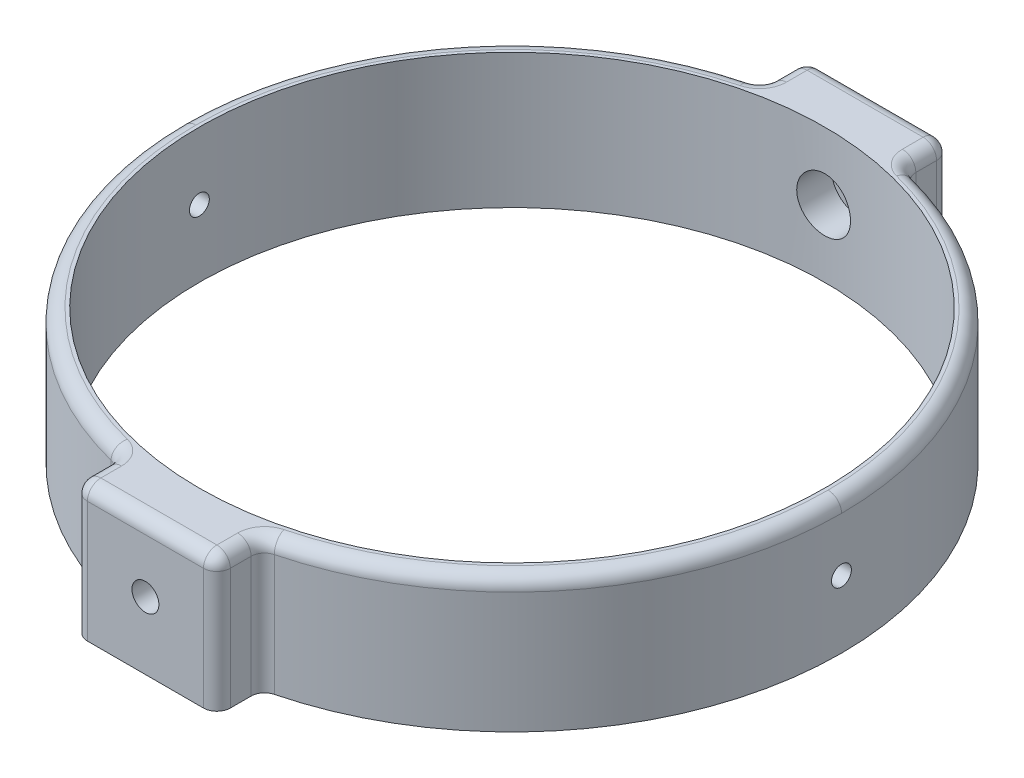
ISO-10303-21;
HEADER;
FILE_DESCRIPTION(('STEP AP214'),'2;1');
FILE_NAME('part.step','',(''),(''),'','','');
FILE_SCHEMA(('AUTOMOTIVE_DESIGN { 1 0 10303 214 1 1 1 1 }'));
ENDSEC;
DATA;
#1=APPLICATION_CONTEXT('core data for automotive mechanical design processes');
#2=APPLICATION_PROTOCOL_DEFINITION('international standard','automotive_design',2000,#1);
#3=PRODUCT_CONTEXT('',#1,'mechanical');
#4=PRODUCT('Part','Part','',(#3));
#5=PRODUCT_RELATED_PRODUCT_CATEGORY('part','',(#4));
#6=PRODUCT_DEFINITION_FORMATION('','',#4);
#7=PRODUCT_DEFINITION_CONTEXT('part definition',#1,'design');
#8=PRODUCT_DEFINITION('design','',#6,#7);
#9=PRODUCT_DEFINITION_SHAPE('','',#8);
#10=(LENGTH_UNIT() NAMED_UNIT(*) SI_UNIT(.MILLI.,.METRE.));
#11=(NAMED_UNIT(*) PLANE_ANGLE_UNIT() SI_UNIT($,.RADIAN.));
#12=(NAMED_UNIT(*) SI_UNIT($,.STERADIAN.) SOLID_ANGLE_UNIT());
#13=UNCERTAINTY_MEASURE_WITH_UNIT(LENGTH_MEASURE(1.E-05),#10,'distance_accuracy_value','');
#14=(GEOMETRIC_REPRESENTATION_CONTEXT(3) GLOBAL_UNCERTAINTY_ASSIGNED_CONTEXT((#13)) GLOBAL_UNIT_ASSIGNED_CONTEXT((#10,
#11,#12)) REPRESENTATION_CONTEXT('',''));
#15=CARTESIAN_POINT('',(0.,0.,0.));
#16=DIRECTION('',(0.,0.,1.));
#17=DIRECTION('',(1.,0.,0.));
#18=AXIS2_PLACEMENT_3D('',#15,#16,#17);
#19=CARTESIAN_POINT('',(0.,20.,0.));
#20=DIRECTION('',(0.,-1.,0.));
#21=DIRECTION('',(0.,0.,-1.));
#22=AXIS2_PLACEMENT_3D('',#19,#20,#21);
#23=CYLINDRICAL_SURFACE('',#22,46.5);
#24=CARTESIAN_POINT('',(-46.4766002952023,10.,-1.475));
#25=CARTESIAN_POINT('',(-46.4766006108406,9.9171709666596,-1.47499633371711));
#26=CARTESIAN_POINT('',(-46.4768240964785,9.8342824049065,-1.46799964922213));
#27=CARTESIAN_POINT('',(-46.4776941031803,9.67078960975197,-1.44018643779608));
#28=CARTESIAN_POINT('',(-46.4783411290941,9.59018822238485,-1.41935341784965));
#29=CARTESIAN_POINT('',(-46.479984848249,9.43366193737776,-1.3644625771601));
#30=CARTESIAN_POINT('',(-46.4809813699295,9.3577347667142,-1.3304112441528));
#31=CARTESIAN_POINT('',(-46.4832115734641,9.21269550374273,-1.25005971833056));
#32=CARTESIAN_POINT('',(-46.4844451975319,9.14358175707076,-1.20376250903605));
#33=CARTESIAN_POINT('',(-46.4870113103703,9.01407592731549,-1.10020684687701));
#34=CARTESIAN_POINT('',(-46.4883438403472,8.95368751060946,-1.04294380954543));
#35=CARTESIAN_POINT('',(-46.4909572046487,8.84337744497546,-0.919090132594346));
#36=CARTESIAN_POINT('',(-46.4922380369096,8.79345621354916,-0.852499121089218));
#37=CARTESIAN_POINT('',(-46.4946038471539,8.70549129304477,-0.711865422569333));
#38=CARTESIAN_POINT('',(-46.4956887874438,8.66744988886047,-0.63782130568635));
#39=CARTESIAN_POINT('',(-46.4975401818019,8.60433931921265,-0.484393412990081));
#40=CARTESIAN_POINT('',(-46.498306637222,8.57927009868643,-0.405009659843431));
#41=CARTESIAN_POINT('',(-46.4994344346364,8.5428236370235,-0.243184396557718));
#42=CARTESIAN_POINT('',(-46.4997959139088,8.53144175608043,-0.160743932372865));
#43=CARTESIAN_POINT('',(-46.5000734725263,8.52267876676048,0.00487826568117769));
#44=CARTESIAN_POINT('',(-46.499989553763,8.52529759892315,0.0880599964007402));
#45=CARTESIAN_POINT('',(-46.4993858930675,8.54445778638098,0.252772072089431));
#46=CARTESIAN_POINT('',(-46.4988663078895,8.56099413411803,0.334303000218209));
#47=CARTESIAN_POINT('',(-46.4974500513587,8.60751219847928,0.493431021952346));
#48=CARTESIAN_POINT('',(-46.4965533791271,8.63749394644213,0.571028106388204));
#49=CARTESIAN_POINT('',(-46.4944837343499,8.71005747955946,0.72010184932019));
#50=CARTESIAN_POINT('',(-46.4933107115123,8.75264155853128,0.791577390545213));
#51=CARTESIAN_POINT('',(-46.4908205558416,8.84919924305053,0.926366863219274));
#52=CARTESIAN_POINT('',(-46.4895034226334,8.90317287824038,0.989680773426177));
#53=CARTESIAN_POINT('',(-46.4868727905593,9.02100590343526,1.10637892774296));
#54=CARTESIAN_POINT('',(-46.4855592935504,9.08486963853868,1.1597587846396));
#55=CARTESIAN_POINT('',(-46.4830846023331,9.22065468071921,1.25503979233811));
#56=CARTESIAN_POINT('',(-46.4819234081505,9.29257598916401,1.29694094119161));
#57=CARTESIAN_POINT('',(-46.4798842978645,9.44243706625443,1.36807463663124));
#58=CARTESIAN_POINT('',(-46.4790063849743,9.5203769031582,1.39730703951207));
#59=CARTESIAN_POINT('',(-46.4776329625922,9.68006147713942,1.44227060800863));
#60=CARTESIAN_POINT('',(-46.4771374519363,9.76180620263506,1.45800181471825));
#61=CARTESIAN_POINT('',(-46.4765849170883,9.92674193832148,1.47551105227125));
#62=CARTESIAN_POINT('',(-46.4765277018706,10.0099323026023,1.47729516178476));
#63=CARTESIAN_POINT('',(-46.4768577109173,10.1754313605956,1.46687540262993));
#64=CARTESIAN_POINT('',(-46.4772449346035,10.2577400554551,1.45467155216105));
#65=CARTESIAN_POINT('',(-46.4784199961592,10.4191223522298,1.41662733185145));
#66=CARTESIAN_POINT('',(-46.4792077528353,10.4981966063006,1.39078972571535));
#67=CARTESIAN_POINT('',(-46.4810950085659,10.6508854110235,1.3262142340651));
#68=CARTESIAN_POINT('',(-46.4821945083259,10.7244999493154,1.28747631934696));
#69=CARTESIAN_POINT('',(-46.4845817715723,10.8642076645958,1.19818418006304));
#70=CARTESIAN_POINT('',(-46.4858696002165,10.9302982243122,1.14762586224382));
#71=CARTESIAN_POINT('',(-46.4884881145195,11.053055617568,1.03613409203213));
#72=CARTESIAN_POINT('',(-46.4898188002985,11.1097224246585,0.975200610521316));
#73=CARTESIAN_POINT('',(-46.4923735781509,11.2120440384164,0.844662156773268));
#74=CARTESIAN_POINT('',(-46.4935976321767,11.2576949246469,0.775054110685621));
#75=CARTESIAN_POINT('',(-46.495800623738,11.3366620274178,0.629158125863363));
#76=CARTESIAN_POINT('',(-46.4967795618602,11.369978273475,0.552870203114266));
#77=CARTESIAN_POINT('',(-46.4983817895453,11.4233234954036,0.395794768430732));
#78=CARTESIAN_POINT('',(-46.4990051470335,11.4433550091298,0.315008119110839));
#79=CARTESIAN_POINT('',(-46.499826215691,11.4695704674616,0.151216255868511));
#80=CARTESIAN_POINT('',(-46.5000239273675,11.475754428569,0.0682110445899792));
#81=CARTESIAN_POINT('',(-46.4999714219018,11.4740989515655,-0.0976225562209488));
#82=CARTESIAN_POINT('',(-46.499721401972,11.4662656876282,-0.180451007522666));
#83=CARTESIAN_POINT('',(-46.4988019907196,11.4368108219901,-0.343616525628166));
#84=CARTESIAN_POINT('',(-46.4981325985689,11.4151891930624,-0.42395358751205));
#85=CARTESIAN_POINT('',(-46.4964498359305,11.3587722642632,-0.579858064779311));
#86=CARTESIAN_POINT('',(-46.4954364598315,11.3239767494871,-0.655425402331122));
#87=CARTESIAN_POINT('',(-46.4931798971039,11.2422017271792,-0.799644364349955));
#88=CARTESIAN_POINT('',(-46.4919367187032,11.1952226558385,-0.868296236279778));
#89=CARTESIAN_POINT('',(-46.4893600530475,11.090395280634,-0.996764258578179));
#90=CARTESIAN_POINT('',(-46.4880265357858,11.0325433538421,-1.05657745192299));
#91=CARTESIAN_POINT('',(-46.4854194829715,10.9076021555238,-1.16565912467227));
#92=CARTESIAN_POINT('',(-46.4841459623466,10.8405106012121,-1.21492499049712));
#93=CARTESIAN_POINT('',(-46.4818020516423,10.6989666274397,-1.30152287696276));
#94=CARTESIAN_POINT('',(-46.4807317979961,10.6245093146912,-1.33884689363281));
#95=CARTESIAN_POINT('',(-46.4789175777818,10.4704391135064,-1.40042088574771));
#96=CARTESIAN_POINT('',(-46.4781732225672,10.3908324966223,-1.42468644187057));
#97=CARTESIAN_POINT('',(-46.47729358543,10.2589362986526,-1.45302845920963));
#98=CARTESIAN_POINT('',(-46.4770347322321,10.2075027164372,-1.46125740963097));
#99=CARTESIAN_POINT('',(-46.476687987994,10.1040539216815,-1.47224433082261));
#100=CARTESIAN_POINT('',(-46.4766000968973,10.0520387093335,-1.47500230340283));
#101=CARTESIAN_POINT('',(-46.4766002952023,10.,-1.475));
#102=B_SPLINE_CURVE_WITH_KNOTS('',3,(#24,#25,#26,#27,#28,#29,#30,#31,#32,#33,#34,#35,#36,#37,
#38,#39,#40,#41,#42,#43,#44,#45,#46,#47,#48,#49,#50,#51,#52,#53,#54,#55,#56,#57,#58,#59,#60,#61,
#62,#63,#64,#65,#66,#67,#68,#69,#70,#71,#72,#73,#74,#75,#76,#77,#78,#79,#80,#81,#82,#83,#84,#85,
#86,#87,#88,#89,#90,#91,#92,#93,#94,#95,#96,#97,#98,#99,#100,#101),.UNSPECIFIED.,.T.,.F.,(4,2,2,
2,2,2,2,2,2,2,2,2,2,2,2,2,2,2,2,2,2,2,2,2,2,2,2,2,2,2,2,2,2,2,2,2,2,2,4),(0.,0.248297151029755,
0.496890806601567,0.745362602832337,0.993773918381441,1.24228931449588,1.49081462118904,
1.73938769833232,1.98795972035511,2.23644745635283,2.48493413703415,2.73333144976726,
2.9817293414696,3.23017247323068,3.47861625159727,3.72716949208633,3.97572277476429,
4.22427887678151,4.47283422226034,4.72128123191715,4.96972791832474,5.21812426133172,
5.46652116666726,5.71500421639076,5.96348796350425,6.21206001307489,6.46063146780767,
6.7091554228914,6.95767908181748,7.20609330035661,7.45450800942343,7.70292677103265,
7.95133664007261,8.19982942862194,8.44838372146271,8.69710425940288,8.9455273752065,
9.10152421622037,9.25752100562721),.UNSPECIFIED.);
#103=CARTESIAN_POINT('',(-46.4766002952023,10.,-1.475));
#104=VERTEX_POINT('',#103);
#105=EDGE_CURVE('E556',#104,#104,#102,.T.);
#106=ORIENTED_EDGE('',*,*,#105,.T.);
#107=EDGE_LOOP('',(#106));
#108=FACE_BOUND('',#107,.T.);
#109=CARTESIAN_POINT('',(46.4766002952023,10.,-1.475));
#110=CARTESIAN_POINT('',(46.4766006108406,10.0828290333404,-1.47499633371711));
#111=CARTESIAN_POINT('',(46.4768240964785,10.1657175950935,-1.46799964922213));
#112=CARTESIAN_POINT('',(46.4776941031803,10.329210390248,-1.44018643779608));
#113=CARTESIAN_POINT('',(46.4783411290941,10.4098117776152,-1.41935341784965));
#114=CARTESIAN_POINT('',(46.479984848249,10.5663380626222,-1.3644625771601));
#115=CARTESIAN_POINT('',(46.4809813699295,10.6422652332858,-1.3304112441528));
#116=CARTESIAN_POINT('',(46.4832115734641,10.7873044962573,-1.25005971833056));
#117=CARTESIAN_POINT('',(46.4844451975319,10.8564182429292,-1.20376250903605));
#118=CARTESIAN_POINT('',(46.4870113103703,10.9859240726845,-1.10020684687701));
#119=CARTESIAN_POINT('',(46.4883438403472,11.0463124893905,-1.04294380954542));
#120=CARTESIAN_POINT('',(46.4909572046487,11.1566225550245,-0.919090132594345));
#121=CARTESIAN_POINT('',(46.4922380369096,11.2065437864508,-0.852499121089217));
#122=CARTESIAN_POINT('',(46.4946038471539,11.2945087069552,-0.711865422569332));
#123=CARTESIAN_POINT('',(46.4956887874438,11.3325501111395,-0.637821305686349));
#124=CARTESIAN_POINT('',(46.4975401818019,11.3956606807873,-0.484393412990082));
#125=CARTESIAN_POINT('',(46.498306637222,11.4207299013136,-0.405009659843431));
#126=CARTESIAN_POINT('',(46.4994344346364,11.4571763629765,-0.243184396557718));
#127=CARTESIAN_POINT('',(46.4997959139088,11.4685582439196,-0.160743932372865));
#128=CARTESIAN_POINT('',(46.5000734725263,11.4773212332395,0.00487826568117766));
#129=CARTESIAN_POINT('',(46.499989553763,11.4747024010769,0.0880599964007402));
#130=CARTESIAN_POINT('',(46.4993858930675,11.455542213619,0.252772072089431));
#131=CARTESIAN_POINT('',(46.4988663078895,11.439005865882,0.33430300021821));
#132=CARTESIAN_POINT('',(46.4974500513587,11.3924878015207,0.493431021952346));
#133=CARTESIAN_POINT('',(46.4965533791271,11.3625060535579,0.571028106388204));
#134=CARTESIAN_POINT('',(46.4944837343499,11.2899425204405,0.72010184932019));
#135=CARTESIAN_POINT('',(46.4933107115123,11.2473584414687,0.791577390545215));
#136=CARTESIAN_POINT('',(46.4908205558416,11.1508007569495,0.926366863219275));
#137=CARTESIAN_POINT('',(46.4895034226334,11.0968271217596,0.989680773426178));
#138=CARTESIAN_POINT('',(46.4868727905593,10.9789940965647,1.10637892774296));
#139=CARTESIAN_POINT('',(46.4855592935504,10.9151303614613,1.1597587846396));
#140=CARTESIAN_POINT('',(46.4830846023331,10.7793453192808,1.25503979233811));
#141=CARTESIAN_POINT('',(46.4819234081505,10.707424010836,1.29694094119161));
#142=CARTESIAN_POINT('',(46.4798842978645,10.5575629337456,1.36807463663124));
#143=CARTESIAN_POINT('',(46.4790063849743,10.4796230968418,1.39730703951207));
#144=CARTESIAN_POINT('',(46.4776329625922,10.3199385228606,1.44227060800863));
#145=CARTESIAN_POINT('',(46.4771374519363,10.2381937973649,1.45800181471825));
#146=CARTESIAN_POINT('',(46.4765849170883,10.0732580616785,1.47551105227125));
#147=CARTESIAN_POINT('',(46.4765277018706,9.99006769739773,1.47729516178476));
#148=CARTESIAN_POINT('',(46.4768577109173,9.82456863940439,1.46687540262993));
#149=CARTESIAN_POINT('',(46.4772449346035,9.74225994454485,1.45467155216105));
#150=CARTESIAN_POINT('',(46.4784199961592,9.58087764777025,1.41662733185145));
#151=CARTESIAN_POINT('',(46.4792077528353,9.50180339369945,1.39078972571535));
#152=CARTESIAN_POINT('',(46.4810950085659,9.34911458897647,1.3262142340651));
#153=CARTESIAN_POINT('',(46.4821945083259,9.27550005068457,1.28747631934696));
#154=CARTESIAN_POINT('',(46.4845817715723,9.13579233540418,1.19818418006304));
#155=CARTESIAN_POINT('',(46.4858696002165,9.06970177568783,1.14762586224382));
#156=CARTESIAN_POINT('',(46.4884881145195,8.94694438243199,1.03613409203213));
#157=CARTESIAN_POINT('',(46.4898188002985,8.89027757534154,0.975200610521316));
#158=CARTESIAN_POINT('',(46.4923735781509,8.78795596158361,0.844662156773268));
#159=CARTESIAN_POINT('',(46.4935976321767,8.74230507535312,0.775054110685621));
#160=CARTESIAN_POINT('',(46.495800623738,8.66333797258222,0.629158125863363));
#161=CARTESIAN_POINT('',(46.4967795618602,8.63002172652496,0.552870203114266));
#162=CARTESIAN_POINT('',(46.4983817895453,8.57667650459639,0.395794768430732));
#163=CARTESIAN_POINT('',(46.4990051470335,8.55664499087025,0.31500811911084));
#164=CARTESIAN_POINT('',(46.499826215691,8.53042953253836,0.151216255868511));
#165=CARTESIAN_POINT('',(46.5000239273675,8.52424557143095,0.0682110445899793));
#166=CARTESIAN_POINT('',(46.4999714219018,8.52590104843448,-0.0976225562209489));
#167=CARTESIAN_POINT('',(46.499721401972,8.53373431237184,-0.180451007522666));
#168=CARTESIAN_POINT('',(46.4988019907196,8.56318917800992,-0.343616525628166));
#169=CARTESIAN_POINT('',(46.4981325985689,8.58481080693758,-0.42395358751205));
#170=CARTESIAN_POINT('',(46.4964498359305,8.64122773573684,-0.579858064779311));
#171=CARTESIAN_POINT('',(46.4954364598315,8.6760232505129,-0.655425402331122));
#172=CARTESIAN_POINT('',(46.4931798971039,8.75779827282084,-0.799644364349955));
#173=CARTESIAN_POINT('',(46.4919367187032,8.80477734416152,-0.868296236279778));
#174=CARTESIAN_POINT('',(46.4893600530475,8.90960471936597,-0.996764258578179));
#175=CARTESIAN_POINT('',(46.4880265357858,8.96745664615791,-1.05657745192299));
#176=CARTESIAN_POINT('',(46.4854194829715,9.09239784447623,-1.16565912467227));
#177=CARTESIAN_POINT('',(46.4841459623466,9.15948939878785,-1.21492499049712));
#178=CARTESIAN_POINT('',(46.4818020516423,9.30103337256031,-1.30152287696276));
#179=CARTESIAN_POINT('',(46.4807317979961,9.37549068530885,-1.33884689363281));
#180=CARTESIAN_POINT('',(46.4789175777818,9.52956088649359,-1.40042088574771));
#181=CARTESIAN_POINT('',(46.4781732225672,9.60916750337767,-1.42468644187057));
#182=CARTESIAN_POINT('',(46.47729358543,9.74106370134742,-1.45302845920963));
#183=CARTESIAN_POINT('',(46.4770347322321,9.7924972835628,-1.46125740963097));
#184=CARTESIAN_POINT('',(46.476687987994,9.89594607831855,-1.47224433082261));
#185=CARTESIAN_POINT('',(46.4766000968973,9.9479612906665,-1.47500230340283));
#186=CARTESIAN_POINT('',(46.4766002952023,10.,-1.475));
#187=B_SPLINE_CURVE_WITH_KNOTS('',3,(#109,#110,#111,#112,#113,#114,#115,#116,#117,#118,#119,
#120,#121,#122,#123,#124,#125,#126,#127,#128,#129,#130,#131,#132,#133,#134,#135,#136,#137,#138,
#139,#140,#141,#142,#143,#144,#145,#146,#147,#148,#149,#150,#151,#152,#153,#154,#155,#156,#157,
#158,#159,#160,#161,#162,#163,#164,#165,#166,#167,#168,#169,#170,#171,#172,#173,#174,#175,#176,
#177,#178,#179,#180,#181,#182,#183,#184,#185,#186),.UNSPECIFIED.,.T.,.F.,(4,2,2,2,2,2,2,2,2,2,2,
2,2,2,2,2,2,2,2,2,2,2,2,2,2,2,2,2,2,2,2,2,2,2,2,2,2,2,4),(0.,0.248297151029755,
0.496890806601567,0.745362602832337,0.993773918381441,1.24228931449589,1.49081462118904,
1.73938769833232,1.98795972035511,2.23644745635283,2.48493413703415,2.73333144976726,
2.9817293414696,3.23017247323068,3.47861625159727,3.72716949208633,3.97572277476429,
4.22427887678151,4.47283422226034,4.72128123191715,4.96972791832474,5.21812426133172,
5.46652116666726,5.71500421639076,5.96348796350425,6.21206001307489,6.46063146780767,
6.7091554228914,6.95767908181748,7.20609330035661,7.45450800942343,7.70292677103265,
7.95133664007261,8.19982942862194,8.44838372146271,8.69710425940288,8.9455273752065,
9.10152421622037,9.25752100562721),.UNSPECIFIED.);
#188=CARTESIAN_POINT('',(46.4766002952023,10.,-1.475));
#189=VERTEX_POINT('',#188);
#190=EDGE_CURVE('E717',#189,#189,#187,.T.);
#191=ORIENTED_EDGE('',*,*,#190,.T.);
#192=EDGE_LOOP('',(#191));
#193=FACE_BOUND('',#192,.T.);
#194=CARTESIAN_POINT('',(0.,0.,0.));
#195=DIRECTION('',(0.,1.,0.));
#196=DIRECTION('',(0.,0.,1.));
#197=AXIS2_PLACEMENT_3D('',#194,#195,#196);
#198=CIRCLE('',#197,46.5);
#199=CARTESIAN_POINT('',(0.,0.,46.5));
#200=VERTEX_POINT('',#199);
#201=EDGE_CURVE('E400',#200,#200,#198,.F.);
#202=ORIENTED_EDGE('',*,*,#201,.T.);
#203=EDGE_LOOP('',(#202));
#204=FACE_BOUND('',#203,.T.);
#205=CARTESIAN_POINT('',(-4.,10.,-46.327637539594));
#206=CARTESIAN_POINT('',(-3.9999902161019,10.2242353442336,-46.3276398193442));
#207=CARTESIAN_POINT('',(-3.98108099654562,10.4486226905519,-46.3292830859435));
#208=CARTESIAN_POINT('',(-3.90592795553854,10.8911869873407,-46.3356784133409));
#209=CARTESIAN_POINT('',(-3.84964200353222,11.1093566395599,-46.3404339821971));
#210=CARTESIAN_POINT('',(-3.70137707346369,11.5330117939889,-46.3525113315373));
#211=CARTESIAN_POINT('',(-3.60941853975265,11.738504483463,-46.3598316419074));
#212=CARTESIAN_POINT('',(-3.39245562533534,12.1310895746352,-46.3762118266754));
#213=CARTESIAN_POINT('',(-3.26745823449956,12.318185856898,-46.3852713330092));
#214=CARTESIAN_POINT('',(-2.98759796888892,12.6692255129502,-46.4041368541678));
#215=CARTESIAN_POINT('',(-2.83266358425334,12.8331117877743,-46.4139446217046));
#216=CARTESIAN_POINT('',(-2.49747892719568,13.1325885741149,-46.4331855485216));
#217=CARTESIAN_POINT('',(-2.31722754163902,13.2681778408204,-46.4426186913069));
#218=CARTESIAN_POINT('',(-1.93618332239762,13.5074030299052,-46.4600642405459));
#219=CARTESIAN_POINT('',(-1.73535923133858,13.6109893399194,-46.4680744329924));
#220=CARTESIAN_POINT('',(-1.31908813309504,13.7829508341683,-46.4817526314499));
#221=CARTESIAN_POINT('',(-1.10364139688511,13.8513266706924,-46.4874206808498));
#222=CARTESIAN_POINT('',(-0.664810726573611,13.9507613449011,-46.495763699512));
#223=CARTESIAN_POINT('',(-0.441447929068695,13.9819128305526,-46.4984460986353));
#224=CARTESIAN_POINT('',(0.00735088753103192,14.006300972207,-46.5005407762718));
#225=CARTESIAN_POINT('',(0.232786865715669,13.9995383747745,-46.4999531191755));
#226=CARTESIAN_POINT('',(0.678704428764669,13.9483660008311,-46.4955800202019));
#227=CARTESIAN_POINT('',(0.899197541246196,13.9040558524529,-46.4918030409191));
#228=CARTESIAN_POINT('',(1.32960528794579,13.7792011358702,-46.4814858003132));
#229=CARTESIAN_POINT('',(1.53951981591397,13.6986562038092,-46.474945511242));
#230=CARTESIAN_POINT('',(1.94312827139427,13.5035075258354,-46.4598228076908));
#231=CARTESIAN_POINT('',(2.13680055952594,13.3888592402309,-46.4512377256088));
#232=CARTESIAN_POINT('',(2.5021907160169,13.1287906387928,-46.4329899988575));
#233=CARTESIAN_POINT('',(2.67390810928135,12.9833696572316,-46.4233273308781));
#234=CARTESIAN_POINT('',(2.99109671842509,12.6653222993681,-46.4039731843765));
#235=CARTESIAN_POINT('',(3.13648112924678,12.4926093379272,-46.3942817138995));
#236=CARTESIAN_POINT('',(3.39620599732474,12.1251822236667,-46.375993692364));
#237=CARTESIAN_POINT('',(3.51054642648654,11.9304680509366,-46.3673971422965));
#238=CARTESIAN_POINT('',(3.70493475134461,11.5245039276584,-46.3522708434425));
#239=CARTESIAN_POINT('',(3.78497801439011,11.3132517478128,-46.3457413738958));
#240=CARTESIAN_POINT('',(3.90843494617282,10.8802379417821,-46.3354940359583));
#241=CARTESIAN_POINT('',(3.95184943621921,10.6584765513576,-46.331776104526));
#242=CARTESIAN_POINT('',(4.00070629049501,10.211499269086,-46.327583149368));
#243=CARTESIAN_POINT('',(4.00626976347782,9.98629670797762,-46.3270977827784));
#244=CARTESIAN_POINT('',(3.97958402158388,9.53816220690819,-46.329397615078));
#245=CARTESIAN_POINT('',(3.94733518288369,9.31523024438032,-46.3321827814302));
#246=CARTESIAN_POINT('',(3.84604126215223,8.87831363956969,-46.3407004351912));
#247=CARTESIAN_POINT('',(3.77705280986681,8.6643157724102,-46.3464283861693));
#248=CARTESIAN_POINT('',(3.60429559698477,8.25093209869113,-46.3601824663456));
#249=CARTESIAN_POINT('',(3.50052624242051,8.05154654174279,-46.368208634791));
#250=CARTESIAN_POINT('',(3.26084685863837,7.6724934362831,-46.3856798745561));
#251=CARTESIAN_POINT('',(3.124856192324,7.49287704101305,-46.3951284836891));
#252=CARTESIAN_POINT('',(2.82471078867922,7.15897816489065,-46.4143680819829));
#253=CARTESIAN_POINT('',(2.66055553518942,7.0046961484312,-46.4241590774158));
#254=CARTESIAN_POINT('',(2.30821706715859,6.72543151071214,-46.4430111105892));
#255=CARTESIAN_POINT('',(2.1199713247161,6.60052762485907,-46.4520701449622));
#256=CARTESIAN_POINT('',(1.72510663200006,6.38410527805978,-46.4684086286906));
#257=CARTESIAN_POINT('',(1.51848787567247,6.29258646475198,-46.4756880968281));
#258=CARTESIAN_POINT('',(1.09302334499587,6.1456670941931,-46.4876380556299));
#259=CARTESIAN_POINT('',(0.874194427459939,6.09021801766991,-46.4923120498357));
#260=CARTESIAN_POINT('',(0.430290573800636,6.01685357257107,-46.4985386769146));
#261=CARTESIAN_POINT('',(0.205215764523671,5.99893744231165,-46.5000913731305));
#262=CARTESIAN_POINT('',(-0.24401513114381,6.00115661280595,-46.4999005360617));
#263=CARTESIAN_POINT('',(-0.468171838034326,6.02116928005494,-46.4981676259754));
#264=CARTESIAN_POINT('',(-0.909927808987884,6.09842201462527,-46.4916212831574));
#265=CARTESIAN_POINT('',(-1.12752706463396,6.15566212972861,-46.4868078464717));
#266=CARTESIAN_POINT('',(-1.54999787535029,6.30571331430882,-46.4746404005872));
#267=CARTESIAN_POINT('',(-1.75487029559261,6.39852196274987,-46.4672865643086));
#268=CARTESIAN_POINT('',(-2.14614631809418,6.61706185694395,-46.4508605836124));
#269=CARTESIAN_POINT('',(-2.3325501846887,6.7427926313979,-46.4417884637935));
#270=CARTESIAN_POINT('',(-2.68222563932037,7.02406819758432,-46.4229089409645));
#271=CARTESIAN_POINT('',(-2.8454240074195,7.17970386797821,-46.4130993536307));
#272=CARTESIAN_POINT('',(-3.14344962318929,7.51620406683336,-46.3938690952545));
#273=CARTESIAN_POINT('',(-3.27827000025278,7.69707468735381,-46.3844485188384));
#274=CARTESIAN_POINT('',(-3.51590790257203,8.07928388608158,-46.3670428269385));
#275=CARTESIAN_POINT('',(-3.61866181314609,8.28066211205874,-46.3590605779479));
#276=CARTESIAN_POINT('',(-3.78876572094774,8.69774600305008,-46.3454701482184));
#277=CARTESIAN_POINT('',(-3.85615630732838,8.91343492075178,-46.3398592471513));
#278=CARTESIAN_POINT('',(-3.93651023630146,9.2753240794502,-46.3330856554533));
#279=CARTESIAN_POINT('',(-3.96028711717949,9.41919879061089,-46.3310520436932));
#280=CARTESIAN_POINT('',(-3.99203515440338,9.70869428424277,-46.3283272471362));
#281=CARTESIAN_POINT('',(-4.00000635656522,9.85431506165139,-46.3276360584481));
#282=CARTESIAN_POINT('',(-4.,10.,-46.327637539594));
#283=B_SPLINE_CURVE_WITH_KNOTS('',3,(#205,#206,#207,#208,#209,#210,#211,#212,#213,#214,#215,
#216,#217,#218,#219,#220,#221,#222,#223,#224,#225,#226,#227,#228,#229,#230,#231,#232,#233,#234,
#235,#236,#237,#238,#239,#240,#241,#242,#243,#244,#245,#246,#247,#248,#249,#250,#251,#252,#253,
#254,#255,#256,#257,#258,#259,#260,#261,#262,#263,#264,#265,#266,#267,#268,#269,#270,#271,#272,
#273,#274,#275,#276,#277,#278,#279,#280,#281,#282),.UNSPECIFIED.,.T.,.F.,(4,2,2,2,2,2,2,2,2,2,2,
2,2,2,2,2,2,2,2,2,2,2,2,2,2,2,2,2,2,2,2,2,2,2,2,2,2,2,4),(0.,0.672174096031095,1.34510714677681,
2.01765510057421,2.69006088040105,3.36409313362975,4.038155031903,4.71325670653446,
5.388345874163,6.06175128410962,6.73514343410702,7.40675438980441,8.07837208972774,
8.75087081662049,9.4233840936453,10.0980754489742,10.7727674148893,11.447550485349,
12.1223184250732,12.7949263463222,13.4675275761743,14.139095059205,14.8106740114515,
15.4839517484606,16.1572418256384,16.8323163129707,17.5073836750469,18.1815410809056,
18.8556848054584,19.5276525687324,20.1996211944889,20.8715440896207,21.5434573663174,
22.2174457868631,22.8915971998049,23.5670776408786,24.2417810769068,24.6784915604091,
25.1152007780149),.UNSPECIFIED.);
#284=CARTESIAN_POINT('',(-4.,10.,-46.327637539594));
#285=VERTEX_POINT('',#284);
#286=EDGE_CURVE('E395',#285,#285,#283,.T.);
#287=ORIENTED_EDGE('',*,*,#286,.T.);
#288=EDGE_LOOP('',(#287));
#289=FACE_BOUND('',#288,.T.);
#290=CARTESIAN_POINT('',(0.,20.,0.));
#291=DIRECTION('',(0.,1.,0.));
#292=DIRECTION('',(0.,0.,1.));
#293=AXIS2_PLACEMENT_3D('',#290,#291,#292);
#294=CIRCLE('',#293,46.5);
#295=CARTESIAN_POINT('',(0.,20.,46.5));
#296=VERTEX_POINT('',#295);
#297=EDGE_CURVE('E415',#296,#296,#294,.F.);
#298=ORIENTED_EDGE('',*,*,#297,.F.);
#299=EDGE_LOOP('',(#298));
#300=FACE_BOUND('',#299,.T.);
#301=CARTESIAN_POINT('',(4.,10.,46.327637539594));
#302=CARTESIAN_POINT('',(3.9999902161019,9.77576465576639,46.3276398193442));
#303=CARTESIAN_POINT('',(3.98108099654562,9.55137730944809,46.3292830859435));
#304=CARTESIAN_POINT('',(3.90592795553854,9.10881301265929,46.3356784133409));
#305=CARTESIAN_POINT('',(3.84964200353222,8.89064336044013,46.3404339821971));
#306=CARTESIAN_POINT('',(3.70137707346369,8.46698820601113,46.3525113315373));
#307=CARTESIAN_POINT('',(3.60941853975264,8.26149551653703,46.3598316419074));
#308=CARTESIAN_POINT('',(3.39245562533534,7.86891042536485,46.3762118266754));
#309=CARTESIAN_POINT('',(3.26745823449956,7.681814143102,46.3852713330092));
#310=CARTESIAN_POINT('',(2.98759796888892,7.33077448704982,46.4041368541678));
#311=CARTESIAN_POINT('',(2.83266358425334,7.16688821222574,46.4139446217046));
#312=CARTESIAN_POINT('',(2.49747892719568,6.86741142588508,46.4331855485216));
#313=CARTESIAN_POINT('',(2.31722754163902,6.73182215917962,46.4426186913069));
#314=CARTESIAN_POINT('',(1.93618332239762,6.49259697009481,46.4600642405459));
#315=CARTESIAN_POINT('',(1.73535923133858,6.38901066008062,46.4680744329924));
#316=CARTESIAN_POINT('',(1.31908813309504,6.2170491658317,46.4817526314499));
#317=CARTESIAN_POINT('',(1.10364139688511,6.14867332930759,46.4874206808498));
#318=CARTESIAN_POINT('',(0.664810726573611,6.04923865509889,46.495763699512));
#319=CARTESIAN_POINT('',(0.441447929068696,6.01808716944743,46.4984460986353));
#320=CARTESIAN_POINT('',(-0.00735088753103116,5.993699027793,46.5005407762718));
#321=CARTESIAN_POINT('',(-0.232786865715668,6.00046162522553,46.4999531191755));
#322=CARTESIAN_POINT('',(-0.678704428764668,6.0516339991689,46.4955800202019));
#323=CARTESIAN_POINT('',(-0.899197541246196,6.09594414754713,46.4918030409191));
#324=CARTESIAN_POINT('',(-1.32960528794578,6.22079886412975,46.4814858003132));
#325=CARTESIAN_POINT('',(-1.53951981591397,6.3013437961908,46.474945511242));
#326=CARTESIAN_POINT('',(-1.94312827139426,6.49649247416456,46.4598228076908));
#327=CARTESIAN_POINT('',(-2.13680055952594,6.6111407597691,46.4512377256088));
#328=CARTESIAN_POINT('',(-2.5021907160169,6.87120936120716,46.4329899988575));
#329=CARTESIAN_POINT('',(-2.67390810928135,7.01663034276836,46.4233273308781));
#330=CARTESIAN_POINT('',(-2.99109671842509,7.33467770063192,46.4039731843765));
#331=CARTESIAN_POINT('',(-3.13648112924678,7.50739066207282,46.3942817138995));
#332=CARTESIAN_POINT('',(-3.39620599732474,7.87481777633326,46.375993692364));
#333=CARTESIAN_POINT('',(-3.51054642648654,8.06953194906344,46.3673971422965));
#334=CARTESIAN_POINT('',(-3.70493475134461,8.47549607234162,46.3522708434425));
#335=CARTESIAN_POINT('',(-3.78497801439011,8.68674825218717,46.3457413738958));
#336=CARTESIAN_POINT('',(-3.90843494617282,9.11976205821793,46.3354940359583));
#337=CARTESIAN_POINT('',(-3.95184943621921,9.34152344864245,46.331776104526));
#338=CARTESIAN_POINT('',(-4.00070629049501,9.78850073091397,46.327583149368));
#339=CARTESIAN_POINT('',(-4.00626976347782,10.0137032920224,46.3270977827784));
#340=CARTESIAN_POINT('',(-3.97958402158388,10.4618377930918,46.329397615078));
#341=CARTESIAN_POINT('',(-3.94733518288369,10.6847697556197,46.3321827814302));
#342=CARTESIAN_POINT('',(-3.84604126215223,11.1216863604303,46.3407004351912));
#343=CARTESIAN_POINT('',(-3.77705280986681,11.3356842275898,46.3464283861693));
#344=CARTESIAN_POINT('',(-3.60429559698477,11.7490679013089,46.3601824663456));
#345=CARTESIAN_POINT('',(-3.50052624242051,11.9484534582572,46.368208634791));
#346=CARTESIAN_POINT('',(-3.26084685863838,12.3275065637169,46.3856798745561));
#347=CARTESIAN_POINT('',(-3.124856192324,12.5071229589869,46.3951284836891));
#348=CARTESIAN_POINT('',(-2.82471078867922,12.8410218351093,46.4143680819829));
#349=CARTESIAN_POINT('',(-2.66055553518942,12.9953038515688,46.4241590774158));
#350=CARTESIAN_POINT('',(-2.30821706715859,13.2745684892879,46.4430111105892));
#351=CARTESIAN_POINT('',(-2.1199713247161,13.3994723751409,46.4520701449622));
#352=CARTESIAN_POINT('',(-1.72510663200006,13.6158947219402,46.4684086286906));
#353=CARTESIAN_POINT('',(-1.51848787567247,13.707413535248,46.4756880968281));
#354=CARTESIAN_POINT('',(-1.09302334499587,13.8543329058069,46.4876380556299));
#355=CARTESIAN_POINT('',(-0.874194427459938,13.9097819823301,46.4923120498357));
#356=CARTESIAN_POINT('',(-0.430290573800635,13.9831464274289,46.4985386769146));
#357=CARTESIAN_POINT('',(-0.205215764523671,14.0010625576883,46.5000913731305));
#358=CARTESIAN_POINT('',(0.244015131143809,13.9988433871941,46.4999005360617));
#359=CARTESIAN_POINT('',(0.468171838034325,13.9788307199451,46.4981676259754));
#360=CARTESIAN_POINT('',(0.909927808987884,13.9015779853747,46.4916212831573));
#361=CARTESIAN_POINT('',(1.12752706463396,13.8443378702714,46.4868078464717));
#362=CARTESIAN_POINT('',(1.54999787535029,13.6942866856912,46.4746404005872));
#363=CARTESIAN_POINT('',(1.75487029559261,13.6014780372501,46.4672865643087));
#364=CARTESIAN_POINT('',(2.14614631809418,13.382938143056,46.4508605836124));
#365=CARTESIAN_POINT('',(2.3325501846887,13.2572073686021,46.4417884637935));
#366=CARTESIAN_POINT('',(2.68222563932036,12.9759318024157,46.4229089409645));
#367=CARTESIAN_POINT('',(2.8454240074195,12.8202961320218,46.4130993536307));
#368=CARTESIAN_POINT('',(3.14344962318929,12.4837959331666,46.3938690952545));
#369=CARTESIAN_POINT('',(3.27827000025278,12.3029253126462,46.3844485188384));
#370=CARTESIAN_POINT('',(3.51590790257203,11.9207161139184,46.3670428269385));
#371=CARTESIAN_POINT('',(3.61866181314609,11.7193378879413,46.3590605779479));
#372=CARTESIAN_POINT('',(3.78876572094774,11.3022539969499,46.3454701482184));
#373=CARTESIAN_POINT('',(3.85615630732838,11.0865650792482,46.3398592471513));
#374=CARTESIAN_POINT('',(3.93651023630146,10.7246759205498,46.3330856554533));
#375=CARTESIAN_POINT('',(3.96028711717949,10.5808012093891,46.3310520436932));
#376=CARTESIAN_POINT('',(3.99203515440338,10.2913057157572,46.3283272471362));
#377=CARTESIAN_POINT('',(4.00000635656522,10.1456849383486,46.3276360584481));
#378=CARTESIAN_POINT('',(4.,10.,46.327637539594));
#379=B_SPLINE_CURVE_WITH_KNOTS('',3,(#301,#302,#303,#304,#305,#306,#307,#308,#309,#310,#311,
#312,#313,#314,#315,#316,#317,#318,#319,#320,#321,#322,#323,#324,#325,#326,#327,#328,#329,#330,
#331,#332,#333,#334,#335,#336,#337,#338,#339,#340,#341,#342,#343,#344,#345,#346,#347,#348,#349,
#350,#351,#352,#353,#354,#355,#356,#357,#358,#359,#360,#361,#362,#363,#364,#365,#366,#367,#368,
#369,#370,#371,#372,#373,#374,#375,#376,#377,#378),.UNSPECIFIED.,.T.,.F.,(4,2,2,2,2,2,2,2,2,2,2,
2,2,2,2,2,2,2,2,2,2,2,2,2,2,2,2,2,2,2,2,2,2,2,2,2,2,2,4),(0.,0.672174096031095,1.34510714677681,
2.01765510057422,2.69006088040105,3.36409313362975,4.03815503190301,4.71325670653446,
5.388345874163,6.06175128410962,6.73514343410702,7.40675438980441,8.07837208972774,
8.75087081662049,9.4233840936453,10.0980754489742,10.7727674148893,11.447550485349,
12.1223184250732,12.7949263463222,13.4675275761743,14.139095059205,14.8106740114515,
15.4839517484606,16.1572418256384,16.8323163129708,17.5073836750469,18.1815410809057,
18.8556848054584,19.5276525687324,20.1996211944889,20.8715440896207,21.5434573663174,
22.2174457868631,22.8915971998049,23.5670776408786,24.2417810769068,24.6784915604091,
25.1152007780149),.UNSPECIFIED.);
#380=CARTESIAN_POINT('',(4.,10.,46.327637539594));
#381=VERTEX_POINT('',#380);
#382=EDGE_CURVE('E339',#381,#381,#379,.T.);
#383=ORIENTED_EDGE('',*,*,#382,.F.);
#384=EDGE_LOOP('',(#383));
#385=FACE_BOUND('',#384,.T.);
#386=ADVANCED_FACE('F47',(#108,#193,#204,#289,#300,#385),#23,.F.);
#387=CARTESIAN_POINT('',(0.,20.,0.));
#388=DIRECTION('',(0.,-1.,0.));
#389=DIRECTION('',(0.,0.,-1.));
#390=AXIS2_PLACEMENT_3D('',#387,#388,#389);
#391=CYLINDRICAL_SURFACE('',#390,49.);
#392=CARTESIAN_POINT('',(48.977794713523,10.,-1.475));
#393=CARTESIAN_POINT('',(48.9777950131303,10.0828312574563,-1.47499633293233));
#394=CARTESIAN_POINT('',(48.978007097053,10.1657220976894,-1.46799927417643));
#395=CARTESIAN_POINT('',(48.978832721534,10.3292195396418,-1.44018448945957));
#396=CARTESIAN_POINT('',(48.9794467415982,10.4098232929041,-1.41935025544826));
#397=CARTESIAN_POINT('',(48.9810066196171,10.566354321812,-1.36445600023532));
#398=CARTESIAN_POINT('',(48.9819523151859,10.6422838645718,-1.33040245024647));
#399=CARTESIAN_POINT('',(48.9840687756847,10.7873274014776,-1.25004550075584));
#400=CARTESIAN_POINT('',(48.9852394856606,10.8564430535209,-1.20374509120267));
#401=CARTESIAN_POINT('',(48.9876746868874,10.985949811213,-1.10018384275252));
#402=CARTESIAN_POINT('',(48.9889392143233,11.0463375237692,-1.04291876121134));
#403=CARTESIAN_POINT('',(48.9914191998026,11.1566456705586,-0.919061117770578));
#404=CARTESIAN_POINT('',(48.9926346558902,11.2065656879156,-0.852468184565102));
#405=CARTESIAN_POINT('',(48.9948796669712,11.2945267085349,-0.711832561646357));
#406=CARTESIAN_POINT('',(48.9959091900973,11.3325656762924,-0.637788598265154));
#407=CARTESIAN_POINT('',(48.9976659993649,11.3956715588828,-0.484361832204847));
#408=CARTESIAN_POINT('',(48.9983932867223,11.4207385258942,-0.404979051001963));
#409=CARTESIAN_POINT('',(48.9994634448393,11.4571815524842,-0.243153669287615));
#410=CARTESIAN_POINT('',(48.9998064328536,11.4685617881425,-0.160712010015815));
#411=CARTESIAN_POINT('',(49.0000697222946,11.4773211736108,0.00491221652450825));
#412=CARTESIAN_POINT('',(48.9999900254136,11.4747003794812,0.0880947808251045));
#413=CARTESIAN_POINT('',(48.9994170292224,11.455535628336,0.252811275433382));
#414=CARTESIAN_POINT('',(48.9989238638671,11.4389961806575,0.334345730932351));
#415=CARTESIAN_POINT('',(48.9975796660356,11.3924705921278,0.493480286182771));
#416=CARTESIAN_POINT('',(48.9967286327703,11.3624844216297,0.571080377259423));
#417=CARTESIAN_POINT('',(48.994764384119,11.2899114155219,0.720157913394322));
#418=CARTESIAN_POINT('',(48.993651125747,11.2473225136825,0.791634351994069));
#419=CARTESIAN_POINT('',(48.9912878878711,11.1507545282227,0.926424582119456));
#420=CARTESIAN_POINT('',(48.9900379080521,11.0967754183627,0.989738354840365));
#421=CARTESIAN_POINT('',(48.9875415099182,10.9789337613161,1.10643229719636));
#422=CARTESIAN_POINT('',(48.9862950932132,10.9150673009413,1.15980851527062));
#423=CARTESIAN_POINT('',(48.9839468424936,10.7792776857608,1.25508176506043));
#424=CARTESIAN_POINT('',(48.9828450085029,10.7073545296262,1.29697879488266));
#425=CARTESIAN_POINT('',(48.9809101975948,10.5574909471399,1.36810392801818));
#426=CARTESIAN_POINT('',(48.9800772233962,10.4795504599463,1.3973319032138));
#427=CARTESIAN_POINT('',(48.9787741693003,10.3198656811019,1.4422867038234));
#428=CARTESIAN_POINT('',(48.9783040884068,10.238121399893,1.45801356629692));
#429=CARTESIAN_POINT('',(48.9777800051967,10.0731838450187,1.47551486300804));
#430=CARTESIAN_POINT('',(48.9777258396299,9.98999115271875,1.47729477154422));
#431=CARTESIAN_POINT('',(48.9780392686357,9.8244881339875,1.46686590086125));
#432=CARTESIAN_POINT('',(48.978406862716,9.74217780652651,1.4546571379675));
#433=CARTESIAN_POINT('',(48.9795222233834,9.58079129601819,1.41660202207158));
#434=CARTESIAN_POINT('',(48.9802699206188,9.50171452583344,1.3907581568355));
#435=CARTESIAN_POINT('',(48.9820611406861,9.34902181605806,1.32616897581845));
#436=CARTESIAN_POINT('',(48.9831046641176,9.27540588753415,1.28742363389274));
#437=CARTESIAN_POINT('',(48.9853702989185,9.13569934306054,1.19811723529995));
#438=CARTESIAN_POINT('',(48.986592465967,9.06961108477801,1.14755249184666));
#439=CARTESIAN_POINT('',(48.9890774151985,8.9468595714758,1.03604805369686));
#440=CARTESIAN_POINT('',(48.9903401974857,8.89019634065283,0.975108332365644));
#441=CARTESIAN_POINT('',(48.9927644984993,8.78788508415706,0.844560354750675));
#442=CARTESIAN_POINT('',(48.9939259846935,8.74224058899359,0.774949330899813));
#443=CARTESIAN_POINT('',(48.9960163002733,8.66328663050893,0.629048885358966));
#444=CARTESIAN_POINT('',(48.9969451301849,8.62997713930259,0.55275947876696));
#445=CARTESIAN_POINT('',(48.9984652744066,8.57664491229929,0.395681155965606));
#446=CARTESIAN_POINT('',(48.99905664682,8.55661988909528,0.31489301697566));
#447=CARTESIAN_POINT('',(48.9998354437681,8.53041753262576,0.151099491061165));
#448=CARTESIAN_POINT('',(49.0000228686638,8.52424018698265,0.0680941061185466));
#449=CARTESIAN_POINT('',(48.999972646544,8.52590880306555,-0.0977423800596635));
#450=CARTESIAN_POINT('',(48.9997351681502,8.53374920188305,-0.180573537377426));
#451=CARTESIAN_POINT('',(48.9988622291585,8.56321930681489,-0.343743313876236));
#452=CARTESIAN_POINT('',(48.9982267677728,8.58484904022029,-0.424081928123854));
#453=CARTESIAN_POINT('',(48.9966294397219,8.64128305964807,-0.579988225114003));
#454=CARTESIAN_POINT('',(48.9956675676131,8.67608756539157,-0.655555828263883));
#455=CARTESIAN_POINT('',(48.9935257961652,8.75788124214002,-0.799773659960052));
#456=CARTESIAN_POINT('',(48.9923459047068,8.80486997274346,-0.86842413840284));
#457=CARTESIAN_POINT('',(48.9899005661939,8.90971464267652,-0.996884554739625));
#458=CARTESIAN_POINT('',(48.9886350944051,8.96757373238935,-1.05669192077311));
#459=CARTESIAN_POINT('',(48.9861611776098,9.09252819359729,-1.16576065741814));
#460=CARTESIAN_POINT('',(48.9849527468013,9.15962584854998,-1.21501941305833));
#461=CARTESIAN_POINT('',(48.9827287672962,9.30117915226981,-1.30160109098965));
#462=CARTESIAN_POINT('',(48.9817133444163,9.37563955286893,-1.33891623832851));
#463=CARTESIAN_POINT('',(48.9799921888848,9.52971393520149,-1.40047220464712));
#464=CARTESIAN_POINT('',(48.979286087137,9.60932164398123,-1.42472861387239));
#465=CARTESIAN_POINT('',(48.9784519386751,9.74119348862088,-1.45305064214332));
#466=CARTESIAN_POINT('',(48.9782065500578,9.79260167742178,-1.46127129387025));
#467=CARTESIAN_POINT('',(48.9778778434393,9.89599874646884,-1.47224712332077));
#468=CARTESIAN_POINT('',(48.97779452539,9.94798762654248,-1.47500230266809));
#469=CARTESIAN_POINT('',(48.977794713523,10.,-1.475));
#470=B_SPLINE_CURVE_WITH_KNOTS('',3,(#392,#393,#394,#395,#396,#397,#398,#399,#400,#401,#402,
#403,#404,#405,#406,#407,#408,#409,#410,#411,#412,#413,#414,#415,#416,#417,#418,#419,#420,#421,
#422,#423,#424,#425,#426,#427,#428,#429,#430,#431,#432,#433,#434,#435,#436,#437,#438,#439,#440,
#441,#442,#443,#444,#445,#446,#447,#448,#449,#450,#451,#452,#453,#454,#455,#456,#457,#458,#459,
#460,#461,#462,#463,#464,#465,#466,#467,#468,#469),.UNSPECIFIED.,.T.,.F.,(4,2,2,2,2,2,2,2,2,2,2,
2,2,2,2,2,2,2,2,2,2,2,2,2,2,2,2,2,2,2,2,2,2,2,2,2,2,2,4),(0.,0.248303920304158,
0.496904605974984,0.745383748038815,0.993802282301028,1.24231713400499,1.49084188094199,
1.73940918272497,1.98797548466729,2.23646592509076,2.48495537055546,2.73336434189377,
2.98177386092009,3.23022412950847,3.47867497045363,3.72722439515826,3.97577386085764,
4.22432583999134,4.47287713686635,4.72133087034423,4.96978431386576,5.21819244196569,
5.46660107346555,5.71508729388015,5.96357415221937,6.21214052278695,6.46070633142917,
6.70922932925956,6.95775210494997,7.20617627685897,7.45460094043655,7.70302974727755,
7.9514495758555,8.19994151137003,8.44849497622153,8.69720991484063,8.94562726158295,
9.10154521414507,9.25746312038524),.UNSPECIFIED.);
#471=CARTESIAN_POINT('',(48.977794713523,10.,-1.475));
#472=VERTEX_POINT('',#471);
#473=EDGE_CURVE('E751',#472,#472,#470,.T.);
#474=ORIENTED_EDGE('',*,*,#473,.F.);
#475=EDGE_LOOP('',(#474));
#476=FACE_BOUND('',#475,.T.);
#477=CARTESIAN_POINT('',(0.,18.,0.));
#478=DIRECTION('',(0.,1.,0.));
#479=DIRECTION('',(0.,0.,1.));
#480=AXIS2_PLACEMENT_3D('',#477,#478,#479);
#481=CIRCLE('',#480,49.);
#482=CARTESIAN_POINT('',(12.1313489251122,18.,-47.4745234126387));
#483=VERTEX_POINT('',#482);
#484=CARTESIAN_POINT('',(49.,18.,0.));
#485=VERTEX_POINT('',#484);
#486=EDGE_CURVE('E244',#483,#485,#481,.F.);
#487=ORIENTED_EDGE('',*,*,#486,.T.);
#488=CARTESIAN_POINT('',(0.,18.,0.));
#489=DIRECTION('',(0.,1.,0.));
#490=DIRECTION('',(0.,0.,1.));
#491=AXIS2_PLACEMENT_3D('',#488,#489,#490);
#492=CIRCLE('',#491,49.);
#493=CARTESIAN_POINT('',(12.1313489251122,18.,47.4745234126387));
#494=VERTEX_POINT('',#493);
#495=EDGE_CURVE('E245',#485,#494,#492,.F.);
#496=ORIENTED_EDGE('',*,*,#495,.T.);
#497=DIRECTION('',(0.,-1.,0.));
#498=VECTOR('',#497,1.);
#499=CARTESIAN_POINT('',(12.1313489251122,20.,47.4745234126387));
#500=LINE('',#499,#498);
#501=CARTESIAN_POINT('',(12.1313489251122,0.,47.4745234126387));
#502=VERTEX_POINT('',#501);
#503=EDGE_CURVE('E227',#494,#502,#500,.T.);
#504=ORIENTED_EDGE('',*,*,#503,.T.);
#505=CARTESIAN_POINT('',(0.,0.,0.));
#506=DIRECTION('',(0.,1.,0.));
#507=DIRECTION('',(0.,0.,1.));
#508=AXIS2_PLACEMENT_3D('',#505,#506,#507);
#509=CIRCLE('',#508,49.);
#510=CARTESIAN_POINT('',(12.1313489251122,0.,-47.4745234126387));
#511=VERTEX_POINT('',#510);
#512=EDGE_CURVE('E441',#511,#502,#509,.F.);
#513=ORIENTED_EDGE('',*,*,#512,.F.);
#514=DIRECTION('',(0.,-1.,0.));
#515=VECTOR('',#514,1.);
#516=CARTESIAN_POINT('',(12.1313489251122,20.,-47.4745234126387));
#517=LINE('',#516,#515);
#518=EDGE_CURVE('E252',#511,#483,#517,.F.);
#519=ORIENTED_EDGE('',*,*,#518,.T.);
#520=EDGE_LOOP('',(#487,#496,#504,#513,#519));
#521=FACE_BOUND('',#520,.T.);
#522=ADVANCED_FACE('F437',(#476,#521),#391,.T.);
#523=CARTESIAN_POINT('',(10.6265060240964,20.,0.));
#524=DIRECTION('',(-1.,0.,0.));
#525=DIRECTION('',(0.,0.,1.));
#526=AXIS2_PLACEMENT_3D('',#523,#524,#525);
#527=PLANE('',#526);
#528=DIRECTION('',(0.,0.,-1.));
#529=VECTOR('',#528,1.);
#530=CARTESIAN_POINT('',(10.6265060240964,0.,0.));
#531=LINE('',#530,#529);
#532=CARTESIAN_POINT('',(10.6265060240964,0.,-49.4122590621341));
#533=VERTEX_POINT('',#532);
#534=CARTESIAN_POINT('',(10.6265060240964,0.,-52.5));
#535=VERTEX_POINT('',#534);
#536=EDGE_CURVE('E642',#533,#535,#531,.T.);
#537=ORIENTED_EDGE('',*,*,#536,.T.);
#538=DIRECTION('',(0.,-1.,0.));
#539=VECTOR('',#538,1.);
#540=CARTESIAN_POINT('',(10.6265060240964,20.,-52.5));
#541=LINE('',#540,#539);
#542=CARTESIAN_POINT('',(10.6265060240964,18.,-52.5));
#543=VERTEX_POINT('',#542);
#544=EDGE_CURVE('E281',#535,#543,#541,.F.);
#545=ORIENTED_EDGE('',*,*,#544,.T.);
#546=DIRECTION('',(0.,0.,-1.));
#547=VECTOR('',#546,1.);
#548=CARTESIAN_POINT('',(10.6265060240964,18.,-47.8338517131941));
#549=LINE('',#548,#547);
#550=CARTESIAN_POINT('',(10.6265060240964,18.,-49.4122590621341));
#551=VERTEX_POINT('',#550);
#552=EDGE_CURVE('E279',#543,#551,#549,.F.);
#553=ORIENTED_EDGE('',*,*,#552,.T.);
#554=DIRECTION('',(0.,-1.,0.));
#555=VECTOR('',#554,1.);
#556=CARTESIAN_POINT('',(10.6265060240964,20.,-49.4122590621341));
#557=LINE('',#556,#555);
#558=EDGE_CURVE('E273',#551,#533,#557,.T.);
#559=ORIENTED_EDGE('',*,*,#558,.T.);
#560=EDGE_LOOP('',(#537,#545,#553,#559));
#561=FACE_BOUND('',#560,.T.);
#562=ADVANCED_FACE('F708',(#561),#527,.F.);
#563=CARTESIAN_POINT('',(0.,20.,-54.5));
#564=DIRECTION('',(0.,0.,1.));
#565=DIRECTION('',(1.,0.,0.));
#566=AXIS2_PLACEMENT_3D('',#563,#564,#565);
#567=PLANE('',#566);
#568=CARTESIAN_POINT('',(0.,10.,-54.5));
#569=DIRECTION('',(0.,0.,1.));
#570=DIRECTION('',(1.,0.,0.));
#571=AXIS2_PLACEMENT_3D('',#568,#569,#570);
#572=CIRCLE('',#571,2.);
#573=CARTESIAN_POINT('',(2.,10.,-54.5));
#574=VERTEX_POINT('',#573);
#575=EDGE_CURVE('E336',#574,#574,#572,.T.);
#576=ORIENTED_EDGE('',*,*,#575,.T.);
#577=EDGE_LOOP('',(#576));
#578=FACE_BOUND('',#577,.T.);
#579=DIRECTION('',(-1.,0.,0.));
#580=VECTOR('',#579,1.);
#581=CARTESIAN_POINT('',(0.,0.,-54.5));
#582=LINE('',#581,#580);
#583=CARTESIAN_POINT('',(8.62650602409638,0.,-54.5));
#584=VERTEX_POINT('',#583);
#585=CARTESIAN_POINT('',(-8.62650602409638,0.,-54.5));
#586=VERTEX_POINT('',#585);
#587=EDGE_CURVE('E643',#584,#586,#582,.T.);
#588=ORIENTED_EDGE('',*,*,#587,.T.);
#589=DIRECTION('',(0.,-1.,0.));
#590=VECTOR('',#589,1.);
#591=CARTESIAN_POINT('',(-8.62650602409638,20.,-54.5));
#592=LINE('',#591,#590);
#593=CARTESIAN_POINT('',(-8.62650602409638,18.,-54.5));
#594=VERTEX_POINT('',#593);
#595=EDGE_CURVE('E275',#586,#594,#592,.F.);
#596=ORIENTED_EDGE('',*,*,#595,.T.);
#597=DIRECTION('',(-1.,0.,0.));
#598=VECTOR('',#597,1.);
#599=CARTESIAN_POINT('',(10.6265060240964,18.,-54.5));
#600=LINE('',#599,#598);
#601=CARTESIAN_POINT('',(8.62650602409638,18.,-54.5));
#602=VERTEX_POINT('',#601);
#603=EDGE_CURVE('E268',#594,#602,#600,.F.);
#604=ORIENTED_EDGE('',*,*,#603,.T.);
#605=DIRECTION('',(0.,-1.,0.));
#606=VECTOR('',#605,1.);
#607=CARTESIAN_POINT('',(8.62650602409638,20.,-54.5));
#608=LINE('',#607,#606);
#609=EDGE_CURVE('E266',#602,#584,#608,.T.);
#610=ORIENTED_EDGE('',*,*,#609,.T.);
#611=EDGE_LOOP('',(#588,#596,#604,#610));
#612=FACE_BOUND('',#611,.T.);
#613=ADVANCED_FACE('F741',(#578,#612),#567,.F.);
#614=CARTESIAN_POINT('',(-10.6265060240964,20.,0.));
#615=DIRECTION('',(-1.,0.,0.));
#616=DIRECTION('',(0.,0.,1.));
#617=AXIS2_PLACEMENT_3D('',#614,#615,#616);
#618=PLANE('',#617);
#619=DIRECTION('',(0.,0.,-1.));
#620=VECTOR('',#619,1.);
#621=CARTESIAN_POINT('',(-10.6265060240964,0.,0.));
#622=LINE('',#621,#620);
#623=CARTESIAN_POINT('',(-10.6265060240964,0.,-49.4122590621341));
#624=VERTEX_POINT('',#623);
#625=CARTESIAN_POINT('',(-10.6265060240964,0.,-52.5));
#626=VERTEX_POINT('',#625);
#627=EDGE_CURVE('E649',#624,#626,#622,.T.);
#628=ORIENTED_EDGE('',*,*,#627,.F.);
#629=DIRECTION('',(0.,-1.,0.));
#630=VECTOR('',#629,1.);
#631=CARTESIAN_POINT('',(-10.6265060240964,20.,-49.4122590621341));
#632=LINE('',#631,#630);
#633=CARTESIAN_POINT('',(-10.6265060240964,18.,-49.4122590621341));
#634=VERTEX_POINT('',#633);
#635=EDGE_CURVE('E257',#624,#634,#632,.F.);
#636=ORIENTED_EDGE('',*,*,#635,.T.);
#637=DIRECTION('',(0.,0.,-1.));
#638=VECTOR('',#637,1.);
#639=CARTESIAN_POINT('',(-10.6265060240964,18.,0.));
#640=LINE('',#639,#638);
#641=CARTESIAN_POINT('',(-10.6265060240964,18.,-52.5));
#642=VERTEX_POINT('',#641);
#643=EDGE_CURVE('E248',#634,#642,#640,.T.);
#644=ORIENTED_EDGE('',*,*,#643,.T.);
#645=DIRECTION('',(0.,-1.,0.));
#646=VECTOR('',#645,1.);
#647=CARTESIAN_POINT('',(-10.6265060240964,0.,-52.5));
#648=LINE('',#647,#646);
#649=EDGE_CURVE('E242',#642,#626,#648,.T.);
#650=ORIENTED_EDGE('',*,*,#649,.T.);
#651=EDGE_LOOP('',(#628,#636,#644,#650));
#652=FACE_BOUND('',#651,.T.);
#653=ADVANCED_FACE('F735',(#652),#618,.T.);
#654=CARTESIAN_POINT('',(0.,20.,0.));
#655=DIRECTION('',(0.,-1.,0.));
#656=DIRECTION('',(0.,0.,-1.));
#657=AXIS2_PLACEMENT_3D('',#654,#655,#656);
#658=CYLINDRICAL_SURFACE('',#657,49.);
#659=CARTESIAN_POINT('',(-49.,8.525,0.));
#660=CARTESIAN_POINT('',(-48.999999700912,8.52500366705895,-0.0828312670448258));
#661=CARTESIAN_POINT('',(-48.9997877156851,8.53200072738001,-0.165722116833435));
#662=CARTESIAN_POINT('',(-48.9989624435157,8.55981551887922,-0.329219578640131));
#663=CARTESIAN_POINT('',(-48.9983486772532,8.58064975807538,-0.409823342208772));
#664=CARTESIAN_POINT('',(-48.9967893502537,8.63554402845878,-0.566354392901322));
#665=CARTESIAN_POINT('',(-48.9958439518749,8.66959758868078,-0.642283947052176));
#666=CARTESIAN_POINT('',(-48.9937279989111,8.74995456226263,-0.787327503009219));
#667=CARTESIAN_POINT('',(-48.9925574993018,8.7962549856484,-0.856443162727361));
#668=CARTESIAN_POINT('',(-48.9901225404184,8.89981624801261,-0.985949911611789));
#669=CARTESIAN_POINT('',(-48.9888580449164,8.95708132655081,-1.04633761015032));
#670=CARTESIAN_POINT('',(-48.9863779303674,9.08093895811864,-1.15664572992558));
#671=CARTESIAN_POINT('',(-48.9851623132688,9.14753188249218,-1.2065657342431));
#672=CARTESIAN_POINT('',(-48.9829168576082,9.28816749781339,-1.29452674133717));
#673=CARTESIAN_POINT('',(-48.9818870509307,9.36221146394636,-1.33256570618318));
#674=CARTESIAN_POINT('',(-48.9801296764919,9.51563823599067,-1.39567158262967));
#675=CARTESIAN_POINT('',(-48.9794021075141,9.59502102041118,-1.42073854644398));
#676=CARTESIAN_POINT('',(-48.9783315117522,9.75684641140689,-1.45718156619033));
#677=CARTESIAN_POINT('',(-48.9779883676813,9.83928807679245,-1.46856179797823));
#678=CARTESIAN_POINT('',(-48.9777249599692,10.0049123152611,-1.47732117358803));
#679=CARTESIAN_POINT('',(-48.9778046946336,10.0880948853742,-1.47470037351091));
#680=CARTESIAN_POINT('',(-48.9783779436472,10.2528113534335,-1.4555356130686));
#681=CARTESIAN_POINT('',(-48.9788713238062,10.3343457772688,-1.43899616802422));
#682=CARTESIAN_POINT('',(-48.9802160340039,10.4934802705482,-1.39247059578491));
#683=CARTESIAN_POINT('',(-48.9810673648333,10.5710803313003,-1.36248443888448));
#684=CARTESIAN_POINT('',(-48.9830321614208,10.7201578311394,-1.28991146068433));
#685=CARTESIAN_POINT('',(-48.984145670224,10.7916342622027,-1.24732256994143));
#686=CARTESIAN_POINT('',(-48.9865092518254,10.9264244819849,-1.15075460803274));
#687=CARTESIAN_POINT('',(-48.9877593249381,10.9897382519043,-1.09677551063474));
#688=CARTESIAN_POINT('',(-48.9902557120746,11.1064322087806,-0.978933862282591));
#689=CARTESIAN_POINT('',(-48.9915020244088,11.1598084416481,-0.915067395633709));
#690=CARTESIAN_POINT('',(-48.9938499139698,11.2550817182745,-0.779277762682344));
#691=CARTESIAN_POINT('',(-48.9949514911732,11.2969787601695,-0.707354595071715));
#692=CARTESIAN_POINT('',(-48.9968857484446,11.368103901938,-0.557491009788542));
#693=CARTESIAN_POINT('',(-48.9977184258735,11.3973318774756,-0.479550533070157));
#694=CARTESIAN_POINT('',(-48.9990209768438,11.4422866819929,-0.319865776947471));
#695=CARTESIAN_POINT('',(-48.9994908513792,11.4580135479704,-0.238121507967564));
#696=CARTESIAN_POINT('',(-49.000014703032,11.475514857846,-0.073183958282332));
#697=CARTESIAN_POINT('',(-49.0000688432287,11.4772947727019,0.0100087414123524));
#698=CARTESIAN_POINT('',(-48.9997555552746,11.4668659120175,0.175511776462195));
#699=CARTESIAN_POINT('',(-48.9993881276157,11.4546571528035,0.257822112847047));
#700=CARTESIAN_POINT('',(-48.9982732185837,11.4166020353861,0.419208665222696));
#701=CARTESIAN_POINT('',(-48.9975258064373,11.3907581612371,0.498285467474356));
#702=CARTESIAN_POINT('',(-48.9957351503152,11.3261689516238,0.650978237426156));
#703=CARTESIAN_POINT('',(-48.9946919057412,11.2874235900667,0.724594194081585));
#704=CARTESIAN_POINT('',(-48.9924267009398,11.1981171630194,0.864300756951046));
#705=CARTESIAN_POINT('',(-48.9912046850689,11.1475524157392,0.930389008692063));
#706=CARTESIAN_POINT('',(-48.9887198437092,11.0360479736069,1.05314050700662));
#707=CARTESIAN_POINT('',(-48.9874570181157,10.9751082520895,1.1098037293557));
#708=CARTESIAN_POINT('',(-48.9850324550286,10.8445602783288,1.21211496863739));
#709=CARTESIAN_POINT('',(-48.9838707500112,10.774949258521,1.25775945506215));
#710=CARTESIAN_POINT('',(-48.9817799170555,10.6290488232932,1.33671339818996));
#711=CARTESIAN_POINT('',(-48.9808507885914,10.5527594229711,1.37002288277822));
#712=CARTESIAN_POINT('',(-48.9793300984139,10.3956810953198,1.42335510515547));
#713=CARTESIAN_POINT('',(-48.9787384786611,10.3148929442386,1.44338012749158));
#714=CARTESIAN_POINT('',(-48.9779593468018,10.1510993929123,1.46958247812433));
#715=CARTESIAN_POINT('',(-48.9777718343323,10.0680939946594,1.47575981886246));
#716=CARTESIAN_POINT('',(-48.9778220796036,9.90225751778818,1.47409118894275));
#717=CARTESIAN_POINT('',(-48.9780596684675,9.81942638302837,1.46625078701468));
#718=CARTESIAN_POINT('',(-48.9789329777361,9.65625665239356,1.43678068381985));
#719=CARTESIAN_POINT('',(-48.9795686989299,9.57591806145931,1.41515095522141));
#720=CARTESIAN_POINT('',(-48.9811665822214,9.4200118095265,1.35871695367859));
#721=CARTESIAN_POINT('',(-48.982128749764,9.34444422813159,1.32391246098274));
#722=CARTESIAN_POINT('',(-48.9842710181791,9.20022643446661,1.24211881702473));
#723=CARTESIAN_POINT('',(-48.9854511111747,9.13157597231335,1.19513010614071));
#724=CARTESIAN_POINT('',(-48.9878966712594,9.00311555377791,1.09028545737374));
#725=CARTESIAN_POINT('',(-48.989162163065,8.94330817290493,1.03242636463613));
#726=CARTESIAN_POINT('',(-48.9916359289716,8.83423940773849,0.90747189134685));
#727=CARTESIAN_POINT('',(-48.9928441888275,8.78498063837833,0.840374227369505));
#728=CARTESIAN_POINT('',(-48.9950677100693,8.69839894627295,0.698820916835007));
#729=CARTESIAN_POINT('',(-48.9960828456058,8.66108379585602,0.624360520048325));
#730=CARTESIAN_POINT('',(-48.9978034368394,8.59952782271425,0.470286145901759));
#731=CARTESIAN_POINT('',(-48.9985092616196,8.5752714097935,0.390678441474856));
#732=CARTESIAN_POINT('',(-48.9993430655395,8.54694937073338,0.258806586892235));
#733=CARTESIAN_POINT('',(-48.9995883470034,8.53872871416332,0.207398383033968));
#734=CARTESIAN_POINT('',(-48.9999169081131,8.52775287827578,0.104001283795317));
#735=CARTESIAN_POINT('',(-49.0000001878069,8.52499769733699,0.0520123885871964));
#736=CARTESIAN_POINT('',(-49.,8.525,0.));
#737=B_SPLINE_CURVE_WITH_KNOTS('',3,(#659,#660,#661,#662,#663,#664,#665,#666,#667,#668,#669,
#670,#671,#672,#673,#674,#675,#676,#677,#678,#679,#680,#681,#682,#683,#684,#685,#686,#687,#688,
#689,#690,#691,#692,#693,#694,#695,#696,#697,#698,#699,#700,#701,#702,#703,#704,#705,#706,#707,
#708,#709,#710,#711,#712,#713,#714,#715,#716,#717,#718,#719,#720,#721,#722,#723,#724,#725,#726,
#727,#728,#729,#730,#731,#732,#733,#734,#735,#736),.UNSPECIFIED.,.T.,.F.,(4,2,2,2,2,2,2,2,2,2,2,
2,2,2,2,2,2,2,2,2,2,2,2,2,2,2,2,2,2,2,2,2,2,2,2,2,2,2,4),(0.,0.248303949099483,0.4969046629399,
0.745383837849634,0.993802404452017,1.2423172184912,1.49084192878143,1.7394092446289,
1.987975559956,2.23646601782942,2.48495548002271,2.73336436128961,2.98177379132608,
3.23022403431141,3.4786748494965,3.7272243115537,3.97577381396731,4.22432575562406,
4.47287701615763,4.72133077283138,4.96978423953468,5.21819245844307,5.46660117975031,
5.71508738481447,5.96357422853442,6.21214058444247,6.46070637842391,6.70922941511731,
6.95775222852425,7.20617633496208,7.45460093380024,7.70302967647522,7.9514494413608,
8.19994141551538,8.44849491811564,8.69720983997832,8.94562717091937,9.10154516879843,
9.25746312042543),.UNSPECIFIED.);
#738=CARTESIAN_POINT('',(-49.,8.525,0.));
#739=VERTEX_POINT('',#738);
#740=EDGE_CURVE('E11',#739,#739,#737,.T.);
#741=ORIENTED_EDGE('',*,*,#740,.T.);
#742=EDGE_LOOP('',(#741));
#743=FACE_BOUND('',#742,.T.);
#744=DIRECTION('',(0.,-1.,0.));
#745=VECTOR('',#744,1.);
#746=CARTESIAN_POINT('',(-12.1313489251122,20.,47.4745234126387));
#747=LINE('',#746,#745);
#748=CARTESIAN_POINT('',(-12.1313489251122,0.,47.4745234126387));
#749=VERTEX_POINT('',#748);
#750=CARTESIAN_POINT('',(-12.1313489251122,18.,47.4745234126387));
#751=VERTEX_POINT('',#750);
#752=EDGE_CURVE('E290',#749,#751,#747,.F.);
#753=ORIENTED_EDGE('',*,*,#752,.T.);
#754=CARTESIAN_POINT('',(0.,18.,0.));
#755=DIRECTION('',(0.,1.,0.));
#756=DIRECTION('',(0.,0.,1.));
#757=AXIS2_PLACEMENT_3D('',#754,#755,#756);
#758=CIRCLE('',#757,49.);
#759=CARTESIAN_POINT('',(-49.,18.,0.));
#760=VERTEX_POINT('',#759);
#761=EDGE_CURVE('E485',#751,#760,#758,.F.);
#762=ORIENTED_EDGE('',*,*,#761,.T.);
#763=CARTESIAN_POINT('',(0.,18.,0.));
#764=DIRECTION('',(0.,1.,0.));
#765=DIRECTION('',(0.,0.,1.));
#766=AXIS2_PLACEMENT_3D('',#763,#764,#765);
#767=CIRCLE('',#766,49.);
#768=CARTESIAN_POINT('',(-12.1313489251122,18.,-47.4745234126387));
#769=VERTEX_POINT('',#768);
#770=EDGE_CURVE('E433',#760,#769,#767,.F.);
#771=ORIENTED_EDGE('',*,*,#770,.T.);
#772=DIRECTION('',(0.,-1.,0.));
#773=VECTOR('',#772,1.);
#774=CARTESIAN_POINT('',(-12.1313489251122,20.,-47.4745234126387));
#775=LINE('',#774,#773);
#776=CARTESIAN_POINT('',(-12.1313489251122,0.,-47.4745234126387));
#777=VERTEX_POINT('',#776);
#778=EDGE_CURVE('E427',#769,#777,#775,.T.);
#779=ORIENTED_EDGE('',*,*,#778,.T.);
#780=CARTESIAN_POINT('',(0.,0.,0.));
#781=DIRECTION('',(0.,1.,0.));
#782=DIRECTION('',(0.,0.,1.));
#783=AXIS2_PLACEMENT_3D('',#780,#781,#782);
#784=CIRCLE('',#783,49.);
#785=EDGE_CURVE('E405',#777,#749,#784,.T.);
#786=ORIENTED_EDGE('',*,*,#785,.T.);
#787=EDGE_LOOP('',(#753,#762,#771,#779,#786));
#788=FACE_BOUND('',#787,.T.);
#789=ADVANCED_FACE('F486',(#743,#788),#658,.T.);
#790=CARTESIAN_POINT('',(0.,20.,0.));
#791=DIRECTION('',(0.,1.,0.));
#792=DIRECTION('',(0.,0.,1.));
#793=AXIS2_PLACEMENT_3D('',#790,#791,#792);
#794=PLANE('',#793);
#795=ORIENTED_EDGE('',*,*,#297,.T.);
#796=EDGE_LOOP('',(#795));
#797=FACE_BOUND('',#796,.T.);
#798=CARTESIAN_POINT('',(12.6265060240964,20.,49.4122590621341));
#799=DIRECTION('',(0.,1.,0.));
#800=DIRECTION('',(0.,0.,1.));
#801=AXIS2_PLACEMENT_3D('',#798,#799,#800);
#802=CIRCLE('',#801,4.);
#803=CARTESIAN_POINT('',(11.636191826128,20.,45.5367877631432));
#804=VERTEX_POINT('',#803);
#805=CARTESIAN_POINT('',(8.62650602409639,20.,49.4122590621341));
#806=VERTEX_POINT('',#805);
#807=EDGE_CURVE('E221',#804,#806,#802,.T.);
#808=ORIENTED_EDGE('',*,*,#807,.F.);
#809=CARTESIAN_POINT('',(0.,20.,0.));
#810=DIRECTION('',(0.,1.,0.));
#811=DIRECTION('',(0.,0.,1.));
#812=AXIS2_PLACEMENT_3D('',#809,#810,#811);
#813=CIRCLE('',#812,47.);
#814=CARTESIAN_POINT('',(47.,20.,0.));
#815=VERTEX_POINT('',#814);
#816=EDGE_CURVE('E215',#804,#815,#813,.T.);
#817=ORIENTED_EDGE('',*,*,#816,.T.);
#818=CARTESIAN_POINT('',(0.,20.,0.));
#819=DIRECTION('',(0.,1.,0.));
#820=DIRECTION('',(0.,0.,1.));
#821=AXIS2_PLACEMENT_3D('',#818,#819,#820);
#822=CIRCLE('',#821,47.);
#823=CARTESIAN_POINT('',(11.636191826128,20.,-45.5367877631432));
#824=VERTEX_POINT('',#823);
#825=EDGE_CURVE('E217',#815,#824,#822,.T.);
#826=ORIENTED_EDGE('',*,*,#825,.T.);
#827=CARTESIAN_POINT('',(12.6265060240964,20.,-49.4122590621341));
#828=DIRECTION('',(0.,1.,0.));
#829=DIRECTION('',(0.,0.,1.));
#830=AXIS2_PLACEMENT_3D('',#827,#828,#829);
#831=CIRCLE('',#830,4.);
#832=CARTESIAN_POINT('',(8.62650602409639,20.,-49.4122590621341));
#833=VERTEX_POINT('',#832);
#834=EDGE_CURVE('E239',#833,#824,#831,.T.);
#835=ORIENTED_EDGE('',*,*,#834,.F.);
#836=DIRECTION('',(0.,0.,-1.));
#837=VECTOR('',#836,1.);
#838=CARTESIAN_POINT('',(8.62650602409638,20.,-54.5));
#839=LINE('',#838,#837);
#840=CARTESIAN_POINT('',(8.62650602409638,20.,-52.5));
#841=VERTEX_POINT('',#840);
#842=EDGE_CURVE('E411',#833,#841,#839,.T.);
#843=ORIENTED_EDGE('',*,*,#842,.T.);
#844=DIRECTION('',(-1.,0.,0.));
#845=VECTOR('',#844,1.);
#846=CARTESIAN_POINT('',(-10.6265060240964,20.,-52.5));
#847=LINE('',#846,#845);
#848=CARTESIAN_POINT('',(-8.62650602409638,20.,-52.5));
#849=VERTEX_POINT('',#848);
#850=EDGE_CURVE('E409',#841,#849,#847,.T.);
#851=ORIENTED_EDGE('',*,*,#850,.T.);
#852=DIRECTION('',(0.,0.,-1.));
#853=VECTOR('',#852,1.);
#854=CARTESIAN_POINT('',(-8.6265060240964,20.,0.));
#855=LINE('',#854,#853);
#856=CARTESIAN_POINT('',(-8.62650602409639,20.,-49.4122590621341));
#857=VERTEX_POINT('',#856);
#858=EDGE_CURVE('E414',#849,#857,#855,.F.);
#859=ORIENTED_EDGE('',*,*,#858,.T.);
#860=CARTESIAN_POINT('',(-12.6265060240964,20.,-49.4122590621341));
#861=DIRECTION('',(0.,1.,0.));
#862=DIRECTION('',(0.,0.,1.));
#863=AXIS2_PLACEMENT_3D('',#860,#861,#862);
#864=CIRCLE('',#863,4.);
#865=CARTESIAN_POINT('',(-11.636191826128,20.,-45.5367877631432));
#866=VERTEX_POINT('',#865);
#867=EDGE_CURVE('E237',#866,#857,#864,.T.);
#868=ORIENTED_EDGE('',*,*,#867,.F.);
#869=CARTESIAN_POINT('',(0.,20.,0.));
#870=DIRECTION('',(0.,1.,0.));
#871=DIRECTION('',(0.,0.,1.));
#872=AXIS2_PLACEMENT_3D('',#869,#870,#871);
#873=CIRCLE('',#872,47.);
#874=CARTESIAN_POINT('',(-47.,20.,0.));
#875=VERTEX_POINT('',#874);
#876=EDGE_CURVE('E421',#866,#875,#873,.T.);
#877=ORIENTED_EDGE('',*,*,#876,.T.);
#878=CARTESIAN_POINT('',(0.,20.,0.));
#879=DIRECTION('',(0.,1.,0.));
#880=DIRECTION('',(0.,0.,1.));
#881=AXIS2_PLACEMENT_3D('',#878,#879,#880);
#882=CIRCLE('',#881,47.);
#883=CARTESIAN_POINT('',(-11.636191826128,20.,45.5367877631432));
#884=VERTEX_POINT('',#883);
#885=EDGE_CURVE('E488',#875,#884,#882,.T.);
#886=ORIENTED_EDGE('',*,*,#885,.T.);
#887=CARTESIAN_POINT('',(-12.6265060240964,20.,49.4122590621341));
#888=DIRECTION('',(0.,1.,0.));
#889=DIRECTION('',(0.,0.,1.));
#890=AXIS2_PLACEMENT_3D('',#887,#888,#889);
#891=CIRCLE('',#890,4.);
#892=CARTESIAN_POINT('',(-8.62650602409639,20.,49.4122590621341));
#893=VERTEX_POINT('',#892);
#894=EDGE_CURVE('E506',#893,#884,#891,.T.);
#895=ORIENTED_EDGE('',*,*,#894,.F.);
#896=DIRECTION('',(0.,0.,1.));
#897=VECTOR('',#896,1.);
#898=CARTESIAN_POINT('',(-8.62650602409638,20.,54.5));
#899=LINE('',#898,#897);
#900=CARTESIAN_POINT('',(-8.62650602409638,20.,52.5));
#901=VERTEX_POINT('',#900);
#902=EDGE_CURVE('E503',#893,#901,#899,.T.);
#903=ORIENTED_EDGE('',*,*,#902,.T.);
#904=DIRECTION('',(-1.,0.,0.));
#905=VECTOR('',#904,1.);
#906=CARTESIAN_POINT('',(0.,20.,52.5));
#907=LINE('',#906,#905);
#908=CARTESIAN_POINT('',(8.62650602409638,20.,52.5));
#909=VERTEX_POINT('',#908);
#910=EDGE_CURVE('E494',#901,#909,#907,.F.);
#911=ORIENTED_EDGE('',*,*,#910,.T.);
#912=DIRECTION('',(0.,0.,1.));
#913=VECTOR('',#912,1.);
#914=CARTESIAN_POINT('',(8.6265060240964,20.,0.));
#915=LINE('',#914,#913);
#916=EDGE_CURVE('E498',#909,#806,#915,.F.);
#917=ORIENTED_EDGE('',*,*,#916,.T.);
#918=EDGE_LOOP('',(#808,#817,#826,#835,#843,#851,#859,#868,#877,#886,#895,#903,#911,#917));
#919=FACE_BOUND('',#918,.T.);
#920=ADVANCED_FACE('F220',(#797,#919),#794,.T.);
#921=CARTESIAN_POINT('',(0.,0.,0.));
#922=DIRECTION('',(0.,1.,0.));
#923=DIRECTION('',(0.,0.,1.));
#924=AXIS2_PLACEMENT_3D('',#921,#922,#923);
#925=PLANE('',#924);
#926=ORIENTED_EDGE('',*,*,#201,.F.);
#927=EDGE_LOOP('',(#926));
#928=FACE_BOUND('',#927,.T.);
#929=DIRECTION('',(-1.,0.,0.));
#930=VECTOR('',#929,1.);
#931=CARTESIAN_POINT('',(0.,0.,54.5));
#932=LINE('',#931,#930);
#933=CARTESIAN_POINT('',(8.62650602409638,0.,54.5));
#934=VERTEX_POINT('',#933);
#935=CARTESIAN_POINT('',(-8.62650602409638,0.,54.5));
#936=VERTEX_POINT('',#935);
#937=EDGE_CURVE('E619',#934,#936,#932,.T.);
#938=ORIENTED_EDGE('',*,*,#937,.T.);
#939=CARTESIAN_POINT('',(-8.62650602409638,0.,52.5));
#940=DIRECTION('',(0.,1.,0.));
#941=DIRECTION('',(0.,0.,1.));
#942=AXIS2_PLACEMENT_3D('',#939,#940,#941);
#943=CIRCLE('',#942,2.);
#944=CARTESIAN_POINT('',(-10.6265060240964,0.,52.5));
#945=VERTEX_POINT('',#944);
#946=EDGE_CURVE('E538',#936,#945,#943,.F.);
#947=ORIENTED_EDGE('',*,*,#946,.T.);
#948=DIRECTION('',(0.,0.,1.));
#949=VECTOR('',#948,1.);
#950=CARTESIAN_POINT('',(-10.6265060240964,0.,0.));
#951=LINE('',#950,#949);
#952=CARTESIAN_POINT('',(-10.6265060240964,0.,49.4122590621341));
#953=VERTEX_POINT('',#952);
#954=EDGE_CURVE('E347',#953,#945,#951,.T.);
#955=ORIENTED_EDGE('',*,*,#954,.F.);
#956=CARTESIAN_POINT('',(-12.6265060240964,0.,49.4122590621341));
#957=DIRECTION('',(0.,1.,0.));
#958=DIRECTION('',(0.,0.,1.));
#959=AXIS2_PLACEMENT_3D('',#956,#957,#958);
#960=CIRCLE('',#959,2.);
#961=EDGE_CURVE('E548',#953,#749,#960,.T.);
#962=ORIENTED_EDGE('',*,*,#961,.T.);
#963=ORIENTED_EDGE('',*,*,#785,.F.);
#964=CARTESIAN_POINT('',(-12.6265060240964,0.,-49.4122590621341));
#965=DIRECTION('',(0.,1.,0.));
#966=DIRECTION('',(0.,0.,1.));
#967=AXIS2_PLACEMENT_3D('',#964,#965,#966);
#968=CIRCLE('',#967,2.);
#969=EDGE_CURVE('E283',#777,#624,#968,.T.);
#970=ORIENTED_EDGE('',*,*,#969,.T.);
#971=ORIENTED_EDGE('',*,*,#627,.T.);
#972=CARTESIAN_POINT('',(-8.62650602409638,0.,-52.5));
#973=DIRECTION('',(0.,1.,0.));
#974=DIRECTION('',(0.,0.,1.));
#975=AXIS2_PLACEMENT_3D('',#972,#973,#974);
#976=CIRCLE('',#975,2.);
#977=EDGE_CURVE('E262',#626,#586,#976,.F.);
#978=ORIENTED_EDGE('',*,*,#977,.T.);
#979=ORIENTED_EDGE('',*,*,#587,.F.);
#980=CARTESIAN_POINT('',(8.62650602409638,0.,-52.5));
#981=DIRECTION('',(0.,1.,0.));
#982=DIRECTION('',(0.,0.,1.));
#983=AXIS2_PLACEMENT_3D('',#980,#981,#982);
#984=CIRCLE('',#983,2.);
#985=EDGE_CURVE('E260',#584,#535,#984,.F.);
#986=ORIENTED_EDGE('',*,*,#985,.T.);
#987=ORIENTED_EDGE('',*,*,#536,.F.);
#988=CARTESIAN_POINT('',(12.6265060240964,0.,-49.4122590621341));
#989=DIRECTION('',(0.,1.,0.));
#990=DIRECTION('',(0.,0.,1.));
#991=AXIS2_PLACEMENT_3D('',#988,#989,#990);
#992=CIRCLE('',#991,2.);
#993=EDGE_CURVE('E287',#533,#511,#992,.T.);
#994=ORIENTED_EDGE('',*,*,#993,.T.);
#995=ORIENTED_EDGE('',*,*,#512,.T.);
#996=CARTESIAN_POINT('',(12.6265060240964,0.,49.4122590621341));
#997=DIRECTION('',(0.,1.,0.));
#998=DIRECTION('',(0.,0.,1.));
#999=AXIS2_PLACEMENT_3D('',#996,#997,#998);
#1000=CIRCLE('',#999,2.);
#1001=CARTESIAN_POINT('',(10.6265060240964,0.,49.4122590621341));
#1002=VERTEX_POINT('',#1001);
#1003=EDGE_CURVE('E64',#502,#1002,#1000,.T.);
#1004=ORIENTED_EDGE('',*,*,#1003,.T.);
#1005=DIRECTION('',(0.,0.,1.));
#1006=VECTOR('',#1005,1.);
#1007=CARTESIAN_POINT('',(10.6265060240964,0.,0.));
#1008=LINE('',#1007,#1006);
#1009=CARTESIAN_POINT('',(10.6265060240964,0.,52.5));
#1010=VERTEX_POINT('',#1009);
#1011=EDGE_CURVE('E298',#1002,#1010,#1008,.T.);
#1012=ORIENTED_EDGE('',*,*,#1011,.T.);
#1013=CARTESIAN_POINT('',(8.62650602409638,0.,52.5));
#1014=DIRECTION('',(0.,1.,0.));
#1015=DIRECTION('',(0.,0.,1.));
#1016=AXIS2_PLACEMENT_3D('',#1013,#1014,#1015);
#1017=CIRCLE('',#1016,2.);
#1018=EDGE_CURVE('E536',#1010,#934,#1017,.F.);
#1019=ORIENTED_EDGE('',*,*,#1018,.T.);
#1020=EDGE_LOOP('',(#938,#947,#955,#962,#963,#970,#971,#978,#979,#986,#987,#994,#995,#1004,
#1012,#1019));
#1021=FACE_BOUND('',#1020,.T.);
#1022=ADVANCED_FACE('F389',(#928,#1021),#925,.F.);
#1023=CARTESIAN_POINT('',(0.,10.,-44.5));
#1024=DIRECTION('',(0.,0.,-1.));
#1025=DIRECTION('',(-1.,0.,0.));
#1026=AXIS2_PLACEMENT_3D('',#1023,#1024,#1025);
#1027=CYLINDRICAL_SURFACE('',#1026,4.);
#1028=CARTESIAN_POINT('',(0.,10.,-51.5));
#1029=DIRECTION('',(0.,0.,-1.));
#1030=DIRECTION('',(-1.,0.,0.));
#1031=AXIS2_PLACEMENT_3D('',#1028,#1029,#1030);
#1032=CIRCLE('',#1031,4.);
#1033=CARTESIAN_POINT('',(-4.,10.,-51.5));
#1034=VERTEX_POINT('',#1033);
#1035=EDGE_CURVE('E402',#1034,#1034,#1032,.T.);
#1036=ORIENTED_EDGE('',*,*,#1035,.T.);
#1037=EDGE_LOOP('',(#1036));
#1038=FACE_BOUND('',#1037,.T.);
#1039=ORIENTED_EDGE('',*,*,#286,.F.);
#1040=EDGE_LOOP('',(#1039));
#1041=FACE_BOUND('',#1040,.T.);
#1042=ADVANCED_FACE('F384',(#1038,#1041),#1027,.F.);
#1043=CARTESIAN_POINT('',(0.,10.,-51.5));
#1044=DIRECTION('',(0.,0.,-1.));
#1045=DIRECTION('',(-1.,0.,0.));
#1046=AXIS2_PLACEMENT_3D('',#1043,#1044,#1045);
#1047=PLANE('',#1046);
#1048=CARTESIAN_POINT('',(0.,10.,-51.5));
#1049=DIRECTION('',(0.,0.,-1.));
#1050=DIRECTION('',(-1.,0.,0.));
#1051=AXIS2_PLACEMENT_3D('',#1048,#1049,#1050);
#1052=CIRCLE('',#1051,2.);
#1053=CARTESIAN_POINT('',(-2.,10.,-51.5));
#1054=VERTEX_POINT('',#1053);
#1055=EDGE_CURVE('E404',#1054,#1054,#1052,.F.);
#1056=ORIENTED_EDGE('',*,*,#1055,.F.);
#1057=EDGE_LOOP('',(#1056));
#1058=FACE_BOUND('',#1057,.T.);
#1059=ORIENTED_EDGE('',*,*,#1035,.F.);
#1060=EDGE_LOOP('',(#1059));
#1061=FACE_BOUND('',#1060,.T.);
#1062=ADVANCED_FACE('F378',(#1058,#1061),#1047,.F.);
#1063=CARTESIAN_POINT('',(0.,10.,0.));
#1064=DIRECTION('',(0.,0.,-1.));
#1065=DIRECTION('',(-1.,0.,0.));
#1066=AXIS2_PLACEMENT_3D('',#1063,#1064,#1065);
#1067=CYLINDRICAL_SURFACE('',#1066,2.);
#1068=ORIENTED_EDGE('',*,*,#575,.F.);
#1069=EDGE_LOOP('',(#1068));
#1070=FACE_BOUND('',#1069,.T.);
#1071=ORIENTED_EDGE('',*,*,#1055,.T.);
#1072=EDGE_LOOP('',(#1071));
#1073=FACE_BOUND('',#1072,.T.);
#1074=ADVANCED_FACE('F374',(#1070,#1073),#1067,.F.);
#1075=CARTESIAN_POINT('',(12.6265060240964,20.,-49.4122590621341));
#1076=DIRECTION('',(0.,-1.,0.));
#1077=DIRECTION('',(0.,0.,-1.));
#1078=AXIS2_PLACEMENT_3D('',#1075,#1076,#1077);
#1079=CYLINDRICAL_SURFACE('',#1078,2.);
#1080=ORIENTED_EDGE('',*,*,#993,.F.);
#1081=ORIENTED_EDGE('',*,*,#558,.F.);
#1082=CARTESIAN_POINT('',(12.6265060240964,18.,-49.4122590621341));
#1083=DIRECTION('',(0.,1.,0.));
#1084=DIRECTION('',(0.,0.,1.));
#1085=AXIS2_PLACEMENT_3D('',#1082,#1083,#1084);
#1086=CIRCLE('',#1085,2.);
#1087=EDGE_CURVE('E333',#483,#551,#1086,.F.);
#1088=ORIENTED_EDGE('',*,*,#1087,.F.);
#1089=ORIENTED_EDGE('',*,*,#518,.F.);
#1090=EDGE_LOOP('',(#1080,#1081,#1088,#1089));
#1091=FACE_BOUND('',#1090,.T.);
#1092=ADVANCED_FACE('F377',(#1091),#1079,.F.);
#1093=CARTESIAN_POINT('',(0.,18.,0.));
#1094=DIRECTION('',(0.,1.,0.));
#1095=DIRECTION('',(0.,0.,1.));
#1096=AXIS2_PLACEMENT_3D('',#1093,#1094,#1095);
#1097=TOROIDAL_SURFACE('',#1096,47.,2.);
#1098=CARTESIAN_POINT('',(47.,18.,0.));
#1099=DIRECTION('',(0.,0.,-1.));
#1100=DIRECTION('',(-1.,0.,0.));
#1101=AXIS2_PLACEMENT_3D('',#1098,#1099,#1100);
#1102=CIRCLE('',#1101,2.);
#1103=EDGE_CURVE('E231',#485,#815,#1102,.F.);
#1104=ORIENTED_EDGE('',*,*,#1103,.F.);
#1105=ORIENTED_EDGE('',*,*,#486,.F.);
#1106=CARTESIAN_POINT('',(11.636191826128,18.,-45.5367877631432));
#1107=DIRECTION('',(-0.968867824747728,0.,-0.247578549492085));
#1108=DIRECTION('',(-0.247578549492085,0.,0.968867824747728));
#1109=AXIS2_PLACEMENT_3D('',#1106,#1107,#1108);
#1110=CIRCLE('',#1109,2.);
#1111=EDGE_CURVE('E236',#824,#483,#1110,.T.);
#1112=ORIENTED_EDGE('',*,*,#1111,.F.);
#1113=ORIENTED_EDGE('',*,*,#825,.F.);
#1114=EDGE_LOOP('',(#1104,#1105,#1112,#1113));
#1115=FACE_BOUND('',#1114,.T.);
#1116=ADVANCED_FACE('F233',(#1115),#1097,.T.);
#1117=CARTESIAN_POINT('',(12.6265060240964,18.,-49.4122590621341));
#1118=DIRECTION('',(0.,1.,0.));
#1119=DIRECTION('',(0.,0.,1.));
#1120=AXIS2_PLACEMENT_3D('',#1117,#1118,#1119);
#1121=TOROIDAL_SURFACE('',#1120,4.,2.);
#1122=ORIENTED_EDGE('',*,*,#1111,.T.);
#1123=ORIENTED_EDGE('',*,*,#1087,.T.);
#1124=CARTESIAN_POINT('',(8.62650602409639,18.,-49.4122590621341));
#1125=DIRECTION('',(0.,0.,1.));
#1126=DIRECTION('',(1.,0.,0.));
#1127=AXIS2_PLACEMENT_3D('',#1124,#1125,#1126);
#1128=CIRCLE('',#1127,2.);
#1129=EDGE_CURVE('E327',#833,#551,#1128,.F.);
#1130=ORIENTED_EDGE('',*,*,#1129,.F.);
#1131=ORIENTED_EDGE('',*,*,#834,.T.);
#1132=EDGE_LOOP('',(#1122,#1123,#1130,#1131));
#1133=FACE_BOUND('',#1132,.T.);
#1134=ADVANCED_FACE('F449',(#1133),#1121,.T.);
#1135=CARTESIAN_POINT('',(8.62650602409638,20.,-52.5));
#1136=DIRECTION('',(0.,-1.,0.));
#1137=DIRECTION('',(0.,0.,-1.));
#1138=AXIS2_PLACEMENT_3D('',#1135,#1136,#1137);
#1139=CYLINDRICAL_SURFACE('',#1138,2.);
#1140=ORIENTED_EDGE('',*,*,#985,.F.);
#1141=ORIENTED_EDGE('',*,*,#609,.F.);
#1142=CARTESIAN_POINT('',(8.62650602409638,18.,-52.5));
#1143=DIRECTION('',(0.,1.,0.));
#1144=DIRECTION('',(0.,0.,1.));
#1145=AXIS2_PLACEMENT_3D('',#1142,#1143,#1144);
#1146=CIRCLE('',#1145,2.);
#1147=EDGE_CURVE('E323',#543,#602,#1146,.T.);
#1148=ORIENTED_EDGE('',*,*,#1147,.F.);
#1149=ORIENTED_EDGE('',*,*,#544,.F.);
#1150=EDGE_LOOP('',(#1140,#1141,#1148,#1149));
#1151=FACE_BOUND('',#1150,.T.);
#1152=ADVANCED_FACE('F883',(#1151),#1139,.T.);
#1153=CARTESIAN_POINT('',(8.6265060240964,18.,0.));
#1154=DIRECTION('',(0.,0.,1.));
#1155=DIRECTION('',(1.,0.,0.));
#1156=AXIS2_PLACEMENT_3D('',#1153,#1154,#1155);
#1157=CYLINDRICAL_SURFACE('',#1156,2.);
#1158=ORIENTED_EDGE('',*,*,#1129,.T.);
#1159=ORIENTED_EDGE('',*,*,#552,.F.);
#1160=CARTESIAN_POINT('',(8.62650602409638,18.,-52.5));
#1161=DIRECTION('',(0.,0.,-1.));
#1162=DIRECTION('',(-1.,0.,0.));
#1163=AXIS2_PLACEMENT_3D('',#1160,#1161,#1162);
#1164=CIRCLE('',#1163,2.);
#1165=EDGE_CURVE('E318',#841,#543,#1164,.T.);
#1166=ORIENTED_EDGE('',*,*,#1165,.F.);
#1167=ORIENTED_EDGE('',*,*,#842,.F.);
#1168=EDGE_LOOP('',(#1158,#1159,#1166,#1167));
#1169=FACE_BOUND('',#1168,.T.);
#1170=ADVANCED_FACE('F456',(#1169),#1157,.T.);
#1171=CARTESIAN_POINT('',(8.62650602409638,18.,-52.5));
#1172=DIRECTION('',(1.,0.,0.));
#1173=DIRECTION('',(0.,0.,-1.));
#1174=AXIS2_PLACEMENT_3D('',#1171,#1172,#1173);
#1175=SPHERICAL_SURFACE('',#1174,2.);
#1176=ORIENTED_EDGE('',*,*,#1165,.T.);
#1177=ORIENTED_EDGE('',*,*,#1147,.T.);
#1178=CARTESIAN_POINT('',(8.62650602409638,18.,-52.5));
#1179=DIRECTION('',(1.,0.,0.));
#1180=DIRECTION('',(0.,0.,-1.));
#1181=AXIS2_PLACEMENT_3D('',#1178,#1179,#1180);
#1182=CIRCLE('',#1181,2.);
#1183=EDGE_CURVE('E317',#841,#602,#1182,.F.);
#1184=ORIENTED_EDGE('',*,*,#1183,.F.);
#1185=EDGE_LOOP('',(#1176,#1177,#1184));
#1186=FACE_BOUND('',#1185,.T.);
#1187=ADVANCED_FACE('F458',(#1186),#1175,.T.);
#1188=CARTESIAN_POINT('',(-8.62650602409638,20.,-52.5));
#1189=DIRECTION('',(0.,1.,0.));
#1190=DIRECTION('',(0.,0.,1.));
#1191=AXIS2_PLACEMENT_3D('',#1188,#1189,#1190);
#1192=CYLINDRICAL_SURFACE('',#1191,2.);
#1193=ORIENTED_EDGE('',*,*,#977,.F.);
#1194=ORIENTED_EDGE('',*,*,#649,.F.);
#1195=CARTESIAN_POINT('',(-8.62650602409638,18.,-52.5));
#1196=DIRECTION('',(0.,1.,0.));
#1197=DIRECTION('',(0.,0.,1.));
#1198=AXIS2_PLACEMENT_3D('',#1195,#1196,#1197);
#1199=CIRCLE('',#1198,2.);
#1200=EDGE_CURVE('E315',#594,#642,#1199,.T.);
#1201=ORIENTED_EDGE('',*,*,#1200,.F.);
#1202=ORIENTED_EDGE('',*,*,#595,.F.);
#1203=EDGE_LOOP('',(#1193,#1194,#1201,#1202));
#1204=FACE_BOUND('',#1203,.T.);
#1205=ADVANCED_FACE('F901',(#1204),#1192,.T.);
#1206=CARTESIAN_POINT('',(0.,18.,-52.5));
#1207=DIRECTION('',(1.,0.,0.));
#1208=DIRECTION('',(0.,0.,-1.));
#1209=AXIS2_PLACEMENT_3D('',#1206,#1207,#1208);
#1210=CYLINDRICAL_SURFACE('',#1209,2.);
#1211=ORIENTED_EDGE('',*,*,#1183,.T.);
#1212=ORIENTED_EDGE('',*,*,#603,.F.);
#1213=CARTESIAN_POINT('',(-8.62650602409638,18.,-52.5));
#1214=DIRECTION('',(-1.,0.,0.));
#1215=DIRECTION('',(0.,0.,1.));
#1216=AXIS2_PLACEMENT_3D('',#1213,#1214,#1215);
#1217=CIRCLE('',#1216,2.);
#1218=EDGE_CURVE('E308',#849,#594,#1217,.T.);
#1219=ORIENTED_EDGE('',*,*,#1218,.F.);
#1220=ORIENTED_EDGE('',*,*,#850,.F.);
#1221=EDGE_LOOP('',(#1211,#1212,#1219,#1220));
#1222=FACE_BOUND('',#1221,.T.);
#1223=ADVANCED_FACE('F462',(#1222),#1210,.T.);
#1224=CARTESIAN_POINT('',(-8.62650602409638,18.,-52.5));
#1225=DIRECTION('',(0.,0.,-1.));
#1226=DIRECTION('',(-1.,0.,0.));
#1227=AXIS2_PLACEMENT_3D('',#1224,#1225,#1226);
#1228=SPHERICAL_SURFACE('',#1227,2.);
#1229=ORIENTED_EDGE('',*,*,#1218,.T.);
#1230=ORIENTED_EDGE('',*,*,#1200,.T.);
#1231=CARTESIAN_POINT('',(-8.62650602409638,18.,-52.5));
#1232=DIRECTION('',(0.,0.,-1.));
#1233=DIRECTION('',(-1.,0.,0.));
#1234=AXIS2_PLACEMENT_3D('',#1231,#1232,#1233);
#1235=CIRCLE('',#1234,2.);
#1236=EDGE_CURVE('E302',#849,#642,#1235,.F.);
#1237=ORIENTED_EDGE('',*,*,#1236,.F.);
#1238=EDGE_LOOP('',(#1229,#1230,#1237));
#1239=FACE_BOUND('',#1238,.T.);
#1240=ADVANCED_FACE('F470',(#1239),#1228,.T.);
#1241=CARTESIAN_POINT('',(-12.6265060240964,20.,-49.4122590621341));
#1242=DIRECTION('',(0.,-1.,0.));
#1243=DIRECTION('',(0.,0.,-1.));
#1244=AXIS2_PLACEMENT_3D('',#1241,#1242,#1243);
#1245=CYLINDRICAL_SURFACE('',#1244,2.);
#1246=ORIENTED_EDGE('',*,*,#969,.F.);
#1247=ORIENTED_EDGE('',*,*,#778,.F.);
#1248=CARTESIAN_POINT('',(-12.6265060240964,18.,-49.4122590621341));
#1249=DIRECTION('',(0.,1.,0.));
#1250=DIRECTION('',(0.,0.,1.));
#1251=AXIS2_PLACEMENT_3D('',#1248,#1249,#1250);
#1252=CIRCLE('',#1251,2.);
#1253=EDGE_CURVE('E297',#634,#769,#1252,.F.);
#1254=ORIENTED_EDGE('',*,*,#1253,.F.);
#1255=ORIENTED_EDGE('',*,*,#635,.F.);
#1256=EDGE_LOOP('',(#1246,#1247,#1254,#1255));
#1257=FACE_BOUND('',#1256,.T.);
#1258=ADVANCED_FACE('F927',(#1257),#1245,.F.);
#1259=CARTESIAN_POINT('',(-8.6265060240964,18.,0.));
#1260=DIRECTION('',(0.,0.,-1.));
#1261=DIRECTION('',(-1.,0.,0.));
#1262=AXIS2_PLACEMENT_3D('',#1259,#1260,#1261);
#1263=CYLINDRICAL_SURFACE('',#1262,2.);
#1264=ORIENTED_EDGE('',*,*,#1236,.T.);
#1265=ORIENTED_EDGE('',*,*,#643,.F.);
#1266=CARTESIAN_POINT('',(-8.62650602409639,18.,-49.4122590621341));
#1267=DIRECTION('',(0.,0.,1.));
#1268=DIRECTION('',(1.,0.,0.));
#1269=AXIS2_PLACEMENT_3D('',#1266,#1267,#1268);
#1270=CIRCLE('',#1269,2.);
#1271=EDGE_CURVE('E294',#857,#634,#1270,.T.);
#1272=ORIENTED_EDGE('',*,*,#1271,.F.);
#1273=ORIENTED_EDGE('',*,*,#858,.F.);
#1274=EDGE_LOOP('',(#1264,#1265,#1272,#1273));
#1275=FACE_BOUND('',#1274,.T.);
#1276=ADVANCED_FACE('F471',(#1275),#1263,.T.);
#1277=CARTESIAN_POINT('',(-12.6265060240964,18.,-49.4122590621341));
#1278=DIRECTION('',(0.,1.,0.));
#1279=DIRECTION('',(0.,0.,1.));
#1280=AXIS2_PLACEMENT_3D('',#1277,#1278,#1279);
#1281=TOROIDAL_SURFACE('',#1280,4.,2.);
#1282=ORIENTED_EDGE('',*,*,#1271,.T.);
#1283=ORIENTED_EDGE('',*,*,#1253,.T.);
#1284=CARTESIAN_POINT('',(-11.636191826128,18.,-45.5367877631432));
#1285=DIRECTION('',(0.968867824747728,0.,-0.247578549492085));
#1286=DIRECTION('',(-0.247578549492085,0.,-0.968867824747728));
#1287=AXIS2_PLACEMENT_3D('',#1284,#1285,#1286);
#1288=CIRCLE('',#1287,2.);
#1289=EDGE_CURVE('E293',#866,#769,#1288,.F.);
#1290=ORIENTED_EDGE('',*,*,#1289,.F.);
#1291=ORIENTED_EDGE('',*,*,#867,.T.);
#1292=EDGE_LOOP('',(#1282,#1283,#1290,#1291));
#1293=FACE_BOUND('',#1292,.T.);
#1294=ADVANCED_FACE('F476',(#1293),#1281,.T.);
#1295=CARTESIAN_POINT('',(0.,18.,0.));
#1296=DIRECTION('',(0.,1.,0.));
#1297=DIRECTION('',(0.,0.,1.));
#1298=AXIS2_PLACEMENT_3D('',#1295,#1296,#1297);
#1299=TOROIDAL_SURFACE('',#1298,47.,2.);
#1300=ORIENTED_EDGE('',*,*,#1289,.T.);
#1301=ORIENTED_EDGE('',*,*,#770,.F.);
#1302=CARTESIAN_POINT('',(-47.,18.,0.));
#1303=DIRECTION('',(0.,0.,-1.));
#1304=DIRECTION('',(-1.,0.,0.));
#1305=AXIS2_PLACEMENT_3D('',#1302,#1303,#1304);
#1306=CIRCLE('',#1305,2.);
#1307=EDGE_CURVE('E430',#875,#760,#1306,.F.);
#1308=ORIENTED_EDGE('',*,*,#1307,.F.);
#1309=ORIENTED_EDGE('',*,*,#876,.F.);
#1310=EDGE_LOOP('',(#1300,#1301,#1308,#1309));
#1311=FACE_BOUND('',#1310,.T.);
#1312=ADVANCED_FACE('F373',(#1311),#1299,.T.);
#1313=CARTESIAN_POINT('',(-10.6265060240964,20.,0.));
#1314=DIRECTION('',(1.,0.,0.));
#1315=DIRECTION('',(0.,0.,-1.));
#1316=AXIS2_PLACEMENT_3D('',#1313,#1314,#1315);
#1317=PLANE('',#1316);
#1318=DIRECTION('',(0.,0.,1.));
#1319=VECTOR('',#1318,1.);
#1320=CARTESIAN_POINT('',(-10.6265060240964,18.,47.8338517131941));
#1321=LINE('',#1320,#1319);
#1322=CARTESIAN_POINT('',(-10.6265060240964,18.,52.5));
#1323=VERTEX_POINT('',#1322);
#1324=CARTESIAN_POINT('',(-10.6265060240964,18.,49.4122590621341));
#1325=VERTEX_POINT('',#1324);
#1326=EDGE_CURVE('E521',#1323,#1325,#1321,.F.);
#1327=ORIENTED_EDGE('',*,*,#1326,.T.);
#1328=DIRECTION('',(0.,1.,0.));
#1329=VECTOR('',#1328,1.);
#1330=CARTESIAN_POINT('',(-10.6265060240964,0.,49.4122590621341));
#1331=LINE('',#1330,#1329);
#1332=EDGE_CURVE('E523',#1325,#953,#1331,.F.);
#1333=ORIENTED_EDGE('',*,*,#1332,.T.);
#1334=ORIENTED_EDGE('',*,*,#954,.T.);
#1335=DIRECTION('',(0.,-1.,0.));
#1336=VECTOR('',#1335,1.);
#1337=CARTESIAN_POINT('',(-10.6265060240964,20.,52.5));
#1338=LINE('',#1337,#1336);
#1339=EDGE_CURVE('E519',#945,#1323,#1338,.F.);
#1340=ORIENTED_EDGE('',*,*,#1339,.T.);
#1341=EDGE_LOOP('',(#1327,#1333,#1334,#1340));
#1342=FACE_BOUND('',#1341,.T.);
#1343=ADVANCED_FACE('F367',(#1342),#1317,.F.);
#1344=CARTESIAN_POINT('',(0.,20.,54.5));
#1345=DIRECTION('',(0.,0.,1.));
#1346=DIRECTION('',(1.,0.,0.));
#1347=AXIS2_PLACEMENT_3D('',#1344,#1345,#1346);
#1348=PLANE('',#1347);
#1349=CARTESIAN_POINT('',(0.,10.,54.5));
#1350=DIRECTION('',(0.,0.,1.));
#1351=DIRECTION('',(1.,0.,0.));
#1352=AXIS2_PLACEMENT_3D('',#1349,#1350,#1351);
#1353=CIRCLE('',#1352,2.);
#1354=CARTESIAN_POINT('',(2.,10.,54.5));
#1355=VERTEX_POINT('',#1354);
#1356=EDGE_CURVE('E599',#1355,#1355,#1353,.T.);
#1357=ORIENTED_EDGE('',*,*,#1356,.F.);
#1358=EDGE_LOOP('',(#1357));
#1359=FACE_BOUND('',#1358,.T.);
#1360=DIRECTION('',(-1.,0.,0.));
#1361=VECTOR('',#1360,1.);
#1362=CARTESIAN_POINT('',(0.,18.,54.5));
#1363=LINE('',#1362,#1361);
#1364=CARTESIAN_POINT('',(8.62650602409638,18.,54.5));
#1365=VERTEX_POINT('',#1364);
#1366=CARTESIAN_POINT('',(-8.62650602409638,18.,54.5));
#1367=VERTEX_POINT('',#1366);
#1368=EDGE_CURVE('E530',#1365,#1367,#1363,.T.);
#1369=ORIENTED_EDGE('',*,*,#1368,.T.);
#1370=DIRECTION('',(0.,-1.,0.));
#1371=VECTOR('',#1370,1.);
#1372=CARTESIAN_POINT('',(-8.62650602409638,0.,54.5));
#1373=LINE('',#1372,#1371);
#1374=EDGE_CURVE('E531',#1367,#936,#1373,.T.);
#1375=ORIENTED_EDGE('',*,*,#1374,.T.);
#1376=ORIENTED_EDGE('',*,*,#937,.F.);
#1377=DIRECTION('',(0.,-1.,0.));
#1378=VECTOR('',#1377,1.);
#1379=CARTESIAN_POINT('',(8.62650602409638,20.,54.5));
#1380=LINE('',#1379,#1378);
#1381=EDGE_CURVE('E527',#934,#1365,#1380,.F.);
#1382=ORIENTED_EDGE('',*,*,#1381,.T.);
#1383=EDGE_LOOP('',(#1369,#1375,#1376,#1382));
#1384=FACE_BOUND('',#1383,.T.);
#1385=ADVANCED_FACE('F366',(#1359,#1384),#1348,.T.);
#1386=CARTESIAN_POINT('',(10.6265060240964,20.,0.));
#1387=DIRECTION('',(1.,0.,0.));
#1388=DIRECTION('',(0.,0.,-1.));
#1389=AXIS2_PLACEMENT_3D('',#1386,#1387,#1388);
#1390=PLANE('',#1389);
#1391=DIRECTION('',(0.,0.,1.));
#1392=VECTOR('',#1391,1.);
#1393=CARTESIAN_POINT('',(10.6265060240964,18.,0.));
#1394=LINE('',#1393,#1392);
#1395=CARTESIAN_POINT('',(10.6265060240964,18.,49.4122590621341));
#1396=VERTEX_POINT('',#1395);
#1397=CARTESIAN_POINT('',(10.6265060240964,18.,52.5));
#1398=VERTEX_POINT('',#1397);
#1399=EDGE_CURVE('E69',#1396,#1398,#1394,.T.);
#1400=ORIENTED_EDGE('',*,*,#1399,.T.);
#1401=DIRECTION('',(0.,-1.,0.));
#1402=VECTOR('',#1401,1.);
#1403=CARTESIAN_POINT('',(10.6265060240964,20.,52.5));
#1404=LINE('',#1403,#1402);
#1405=EDGE_CURVE('E546',#1398,#1010,#1404,.T.);
#1406=ORIENTED_EDGE('',*,*,#1405,.T.);
#1407=ORIENTED_EDGE('',*,*,#1011,.F.);
#1408=DIRECTION('',(0.,1.,0.));
#1409=VECTOR('',#1408,1.);
#1410=CARTESIAN_POINT('',(10.6265060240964,20.,49.4122590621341));
#1411=LINE('',#1410,#1409);
#1412=EDGE_CURVE('E75',#1002,#1396,#1411,.T.);
#1413=ORIENTED_EDGE('',*,*,#1412,.T.);
#1414=EDGE_LOOP('',(#1400,#1406,#1407,#1413));
#1415=FACE_BOUND('',#1414,.T.);
#1416=ADVANCED_FACE('F363',(#1415),#1390,.T.);
#1417=CARTESIAN_POINT('',(0.,10.,44.5));
#1418=DIRECTION('',(0.,0.,1.));
#1419=DIRECTION('',(1.,0.,0.));
#1420=AXIS2_PLACEMENT_3D('',#1417,#1418,#1419);
#1421=CYLINDRICAL_SURFACE('',#1420,4.);
#1422=CARTESIAN_POINT('',(0.,10.,51.5));
#1423=DIRECTION('',(0.,0.,-1.));
#1424=DIRECTION('',(-1.,0.,0.));
#1425=AXIS2_PLACEMENT_3D('',#1422,#1423,#1424);
#1426=CIRCLE('',#1425,4.);
#1427=CARTESIAN_POINT('',(-4.,10.,51.5));
#1428=VERTEX_POINT('',#1427);
#1429=EDGE_CURVE('E348',#1428,#1428,#1426,.T.);
#1430=ORIENTED_EDGE('',*,*,#1429,.F.);
#1431=EDGE_LOOP('',(#1430));
#1432=FACE_BOUND('',#1431,.T.);
#1433=ORIENTED_EDGE('',*,*,#382,.T.);
#1434=EDGE_LOOP('',(#1433));
#1435=FACE_BOUND('',#1434,.T.);
#1436=ADVANCED_FACE('F355',(#1432,#1435),#1421,.F.);
#1437=CARTESIAN_POINT('',(0.,10.,51.5));
#1438=DIRECTION('',(0.,0.,1.));
#1439=DIRECTION('',(-1.,0.,0.));
#1440=AXIS2_PLACEMENT_3D('',#1437,#1438,#1439);
#1441=PLANE('',#1440);
#1442=CARTESIAN_POINT('',(0.,10.,51.5));
#1443=DIRECTION('',(0.,0.,1.));
#1444=DIRECTION('',(1.,0.,0.));
#1445=AXIS2_PLACEMENT_3D('',#1442,#1443,#1444);
#1446=CIRCLE('',#1445,2.);
#1447=CARTESIAN_POINT('',(2.,10.,51.5));
#1448=VERTEX_POINT('',#1447);
#1449=EDGE_CURVE('E349',#1448,#1448,#1446,.T.);
#1450=ORIENTED_EDGE('',*,*,#1449,.T.);
#1451=EDGE_LOOP('',(#1450));
#1452=FACE_BOUND('',#1451,.T.);
#1453=ORIENTED_EDGE('',*,*,#1429,.T.);
#1454=EDGE_LOOP('',(#1453));
#1455=FACE_BOUND('',#1454,.T.);
#1456=ADVANCED_FACE('F359',(#1452,#1455),#1441,.F.);
#1457=CARTESIAN_POINT('',(0.,10.,-54.5));
#1458=DIRECTION('',(0.,0.,1.));
#1459=DIRECTION('',(1.,0.,0.));
#1460=AXIS2_PLACEMENT_3D('',#1457,#1458,#1459);
#1461=CYLINDRICAL_SURFACE('',#1460,2.);
#1462=ORIENTED_EDGE('',*,*,#1356,.T.);
#1463=EDGE_LOOP('',(#1462));
#1464=FACE_BOUND('',#1463,.T.);
#1465=ORIENTED_EDGE('',*,*,#1449,.F.);
#1466=EDGE_LOOP('',(#1465));
#1467=FACE_BOUND('',#1466,.T.);
#1468=ADVANCED_FACE('F766',(#1464,#1467),#1461,.F.);
#1469=CARTESIAN_POINT('',(0.,18.,0.));
#1470=DIRECTION('',(0.,1.,0.));
#1471=DIRECTION('',(0.,0.,1.));
#1472=AXIS2_PLACEMENT_3D('',#1469,#1470,#1471);
#1473=TOROIDAL_SURFACE('',#1472,47.,2.);
#1474=ORIENTED_EDGE('',*,*,#1103,.T.);
#1475=ORIENTED_EDGE('',*,*,#816,.F.);
#1476=CARTESIAN_POINT('',(11.636191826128,18.,45.5367877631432));
#1477=DIRECTION('',(-0.968867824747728,0.,0.247578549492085));
#1478=DIRECTION('',(0.247578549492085,0.,0.968867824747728));
#1479=AXIS2_PLACEMENT_3D('',#1476,#1477,#1478);
#1480=CIRCLE('',#1479,2.);
#1481=EDGE_CURVE('E600',#494,#804,#1480,.T.);
#1482=ORIENTED_EDGE('',*,*,#1481,.F.);
#1483=ORIENTED_EDGE('',*,*,#495,.F.);
#1484=EDGE_LOOP('',(#1474,#1475,#1482,#1483));
#1485=FACE_BOUND('',#1484,.T.);
#1486=ADVANCED_FACE('F51',(#1485),#1473,.T.);
#1487=CARTESIAN_POINT('',(12.6265060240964,20.,49.4122590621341));
#1488=DIRECTION('',(0.,-1.,0.));
#1489=DIRECTION('',(0.,0.,-1.));
#1490=AXIS2_PLACEMENT_3D('',#1487,#1488,#1489);
#1491=CYLINDRICAL_SURFACE('',#1490,2.);
#1492=ORIENTED_EDGE('',*,*,#1003,.F.);
#1493=ORIENTED_EDGE('',*,*,#503,.F.);
#1494=CARTESIAN_POINT('',(12.6265060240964,18.,49.4122590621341));
#1495=DIRECTION('',(0.,1.,0.));
#1496=DIRECTION('',(0.,0.,1.));
#1497=AXIS2_PLACEMENT_3D('',#1494,#1495,#1496);
#1498=CIRCLE('',#1497,2.);
#1499=EDGE_CURVE('E593',#1396,#494,#1498,.F.);
#1500=ORIENTED_EDGE('',*,*,#1499,.F.);
#1501=ORIENTED_EDGE('',*,*,#1412,.F.);
#1502=EDGE_LOOP('',(#1492,#1493,#1500,#1501));
#1503=FACE_BOUND('',#1502,.T.);
#1504=ADVANCED_FACE('F694',(#1503),#1491,.F.);
#1505=CARTESIAN_POINT('',(12.6265060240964,18.,49.4122590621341));
#1506=DIRECTION('',(0.,1.,0.));
#1507=DIRECTION('',(0.,0.,1.));
#1508=AXIS2_PLACEMENT_3D('',#1505,#1506,#1507);
#1509=TOROIDAL_SURFACE('',#1508,4.,2.);
#1510=ORIENTED_EDGE('',*,*,#1481,.T.);
#1511=ORIENTED_EDGE('',*,*,#807,.T.);
#1512=CARTESIAN_POINT('',(8.62650602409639,18.,49.4122590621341));
#1513=DIRECTION('',(0.,0.,-1.));
#1514=DIRECTION('',(-1.,0.,0.));
#1515=AXIS2_PLACEMENT_3D('',#1512,#1513,#1514);
#1516=CIRCLE('',#1515,2.);
#1517=EDGE_CURVE('E589',#1396,#806,#1516,.F.);
#1518=ORIENTED_EDGE('',*,*,#1517,.F.);
#1519=ORIENTED_EDGE('',*,*,#1499,.T.);
#1520=EDGE_LOOP('',(#1510,#1511,#1518,#1519));
#1521=FACE_BOUND('',#1520,.T.);
#1522=ADVANCED_FACE('F696',(#1521),#1509,.T.);
#1523=CARTESIAN_POINT('',(8.6265060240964,18.,0.));
#1524=DIRECTION('',(0.,0.,1.));
#1525=DIRECTION('',(1.,0.,0.));
#1526=AXIS2_PLACEMENT_3D('',#1523,#1524,#1525);
#1527=CYLINDRICAL_SURFACE('',#1526,2.);
#1528=ORIENTED_EDGE('',*,*,#1517,.T.);
#1529=ORIENTED_EDGE('',*,*,#916,.F.);
#1530=CARTESIAN_POINT('',(8.62650602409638,18.,52.5));
#1531=DIRECTION('',(0.,0.,1.));
#1532=DIRECTION('',(1.,0.,0.));
#1533=AXIS2_PLACEMENT_3D('',#1530,#1531,#1532);
#1534=CIRCLE('',#1533,2.);
#1535=EDGE_CURVE('E586',#1398,#909,#1534,.T.);
#1536=ORIENTED_EDGE('',*,*,#1535,.F.);
#1537=ORIENTED_EDGE('',*,*,#1399,.F.);
#1538=EDGE_LOOP('',(#1528,#1529,#1536,#1537));
#1539=FACE_BOUND('',#1538,.T.);
#1540=ADVANCED_FACE('F682',(#1539),#1527,.T.);
#1541=CARTESIAN_POINT('',(8.62650602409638,20.,52.5));
#1542=DIRECTION('',(0.,-1.,0.));
#1543=DIRECTION('',(0.,0.,-1.));
#1544=AXIS2_PLACEMENT_3D('',#1541,#1542,#1543);
#1545=CYLINDRICAL_SURFACE('',#1544,2.);
#1546=ORIENTED_EDGE('',*,*,#1018,.F.);
#1547=ORIENTED_EDGE('',*,*,#1405,.F.);
#1548=CARTESIAN_POINT('',(8.62650602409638,18.,52.5));
#1549=DIRECTION('',(0.,1.,0.));
#1550=DIRECTION('',(0.,0.,1.));
#1551=AXIS2_PLACEMENT_3D('',#1548,#1549,#1550);
#1552=CIRCLE('',#1551,2.);
#1553=EDGE_CURVE('E582',#1365,#1398,#1552,.T.);
#1554=ORIENTED_EDGE('',*,*,#1553,.F.);
#1555=ORIENTED_EDGE('',*,*,#1381,.F.);
#1556=EDGE_LOOP('',(#1546,#1547,#1554,#1555));
#1557=FACE_BOUND('',#1556,.T.);
#1558=ADVANCED_FACE('F687',(#1557),#1545,.T.);
#1559=CARTESIAN_POINT('',(8.62650602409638,18.,52.5));
#1560=DIRECTION('',(1.,0.,0.));
#1561=DIRECTION('',(0.,0.,-1.));
#1562=AXIS2_PLACEMENT_3D('',#1559,#1560,#1561);
#1563=SPHERICAL_SURFACE('',#1562,2.);
#1564=ORIENTED_EDGE('',*,*,#1553,.T.);
#1565=ORIENTED_EDGE('',*,*,#1535,.T.);
#1566=CARTESIAN_POINT('',(8.62650602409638,18.,52.5));
#1567=DIRECTION('',(1.,0.,0.));
#1568=DIRECTION('',(0.,0.,-1.));
#1569=AXIS2_PLACEMENT_3D('',#1566,#1567,#1568);
#1570=CIRCLE('',#1569,2.);
#1571=EDGE_CURVE('E579',#1365,#909,#1570,.F.);
#1572=ORIENTED_EDGE('',*,*,#1571,.F.);
#1573=EDGE_LOOP('',(#1564,#1565,#1572));
#1574=FACE_BOUND('',#1573,.T.);
#1575=ADVANCED_FACE('F684',(#1574),#1563,.T.);
#1576=CARTESIAN_POINT('',(0.,18.,52.5));
#1577=DIRECTION('',(-1.,0.,0.));
#1578=DIRECTION('',(0.,0.,1.));
#1579=AXIS2_PLACEMENT_3D('',#1576,#1577,#1578);
#1580=CYLINDRICAL_SURFACE('',#1579,2.);
#1581=ORIENTED_EDGE('',*,*,#1571,.T.);
#1582=ORIENTED_EDGE('',*,*,#910,.F.);
#1583=CARTESIAN_POINT('',(-8.62650602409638,18.,52.5));
#1584=DIRECTION('',(-1.,0.,0.));
#1585=DIRECTION('',(0.,0.,1.));
#1586=AXIS2_PLACEMENT_3D('',#1583,#1584,#1585);
#1587=CIRCLE('',#1586,2.);
#1588=EDGE_CURVE('E573',#1367,#901,#1587,.T.);
#1589=ORIENTED_EDGE('',*,*,#1588,.F.);
#1590=ORIENTED_EDGE('',*,*,#1368,.F.);
#1591=EDGE_LOOP('',(#1581,#1582,#1589,#1590));
#1592=FACE_BOUND('',#1591,.T.);
#1593=ADVANCED_FACE('F677',(#1592),#1580,.T.);
#1594=CARTESIAN_POINT('',(-8.62650602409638,20.,52.5));
#1595=DIRECTION('',(0.,1.,0.));
#1596=DIRECTION('',(0.,0.,1.));
#1597=AXIS2_PLACEMENT_3D('',#1594,#1595,#1596);
#1598=CYLINDRICAL_SURFACE('',#1597,2.);
#1599=ORIENTED_EDGE('',*,*,#946,.F.);
#1600=ORIENTED_EDGE('',*,*,#1374,.F.);
#1601=CARTESIAN_POINT('',(-8.62650602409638,18.,52.5));
#1602=DIRECTION('',(0.,1.,0.));
#1603=DIRECTION('',(0.,0.,1.));
#1604=AXIS2_PLACEMENT_3D('',#1601,#1602,#1603);
#1605=CIRCLE('',#1604,2.);
#1606=EDGE_CURVE('E569',#1323,#1367,#1605,.T.);
#1607=ORIENTED_EDGE('',*,*,#1606,.F.);
#1608=ORIENTED_EDGE('',*,*,#1339,.F.);
#1609=EDGE_LOOP('',(#1599,#1600,#1607,#1608));
#1610=FACE_BOUND('',#1609,.T.);
#1611=ADVANCED_FACE('F1003',(#1610),#1598,.T.);
#1612=CARTESIAN_POINT('',(-8.62650602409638,18.,52.5));
#1613=DIRECTION('',(0.,0.,1.));
#1614=DIRECTION('',(1.,0.,0.));
#1615=AXIS2_PLACEMENT_3D('',#1612,#1613,#1614);
#1616=SPHERICAL_SURFACE('',#1615,2.);
#1617=ORIENTED_EDGE('',*,*,#1606,.T.);
#1618=ORIENTED_EDGE('',*,*,#1588,.T.);
#1619=CARTESIAN_POINT('',(-8.62650602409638,18.,52.5));
#1620=DIRECTION('',(0.,0.,1.));
#1621=DIRECTION('',(1.,0.,0.));
#1622=AXIS2_PLACEMENT_3D('',#1619,#1620,#1621);
#1623=CIRCLE('',#1622,2.);
#1624=EDGE_CURVE('E566',#1323,#901,#1623,.F.);
#1625=ORIENTED_EDGE('',*,*,#1624,.F.);
#1626=EDGE_LOOP('',(#1617,#1618,#1625));
#1627=FACE_BOUND('',#1626,.T.);
#1628=ADVANCED_FACE('F675',(#1627),#1616,.T.);
#1629=CARTESIAN_POINT('',(-8.6265060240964,18.,0.));
#1630=DIRECTION('',(0.,0.,-1.));
#1631=DIRECTION('',(-1.,0.,0.));
#1632=AXIS2_PLACEMENT_3D('',#1629,#1630,#1631);
#1633=CYLINDRICAL_SURFACE('',#1632,2.);
#1634=ORIENTED_EDGE('',*,*,#1624,.T.);
#1635=ORIENTED_EDGE('',*,*,#902,.F.);
#1636=CARTESIAN_POINT('',(-8.62650602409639,18.,49.4122590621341));
#1637=DIRECTION('',(0.,0.,-1.));
#1638=DIRECTION('',(-1.,0.,0.));
#1639=AXIS2_PLACEMENT_3D('',#1636,#1637,#1638);
#1640=CIRCLE('',#1639,2.);
#1641=EDGE_CURVE('E565',#1325,#893,#1640,.T.);
#1642=ORIENTED_EDGE('',*,*,#1641,.F.);
#1643=ORIENTED_EDGE('',*,*,#1326,.F.);
#1644=EDGE_LOOP('',(#1634,#1635,#1642,#1643));
#1645=FACE_BOUND('',#1644,.T.);
#1646=ADVANCED_FACE('F669',(#1645),#1633,.T.);
#1647=CARTESIAN_POINT('',(-12.6265060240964,20.,49.4122590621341));
#1648=DIRECTION('',(0.,-1.,0.));
#1649=DIRECTION('',(0.,0.,-1.));
#1650=AXIS2_PLACEMENT_3D('',#1647,#1648,#1649);
#1651=CYLINDRICAL_SURFACE('',#1650,2.);
#1652=ORIENTED_EDGE('',*,*,#961,.F.);
#1653=ORIENTED_EDGE('',*,*,#1332,.F.);
#1654=CARTESIAN_POINT('',(-12.6265060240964,18.,49.4122590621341));
#1655=DIRECTION('',(0.,1.,0.));
#1656=DIRECTION('',(0.,0.,1.));
#1657=AXIS2_PLACEMENT_3D('',#1654,#1655,#1656);
#1658=CIRCLE('',#1657,2.);
#1659=EDGE_CURVE('E560',#751,#1325,#1658,.F.);
#1660=ORIENTED_EDGE('',*,*,#1659,.F.);
#1661=ORIENTED_EDGE('',*,*,#752,.F.);
#1662=EDGE_LOOP('',(#1652,#1653,#1660,#1661));
#1663=FACE_BOUND('',#1662,.T.);
#1664=ADVANCED_FACE('F658',(#1663),#1651,.F.);
#1665=CARTESIAN_POINT('',(-12.6265060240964,18.,49.4122590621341));
#1666=DIRECTION('',(0.,1.,0.));
#1667=DIRECTION('',(0.,0.,1.));
#1668=AXIS2_PLACEMENT_3D('',#1665,#1666,#1667);
#1669=TOROIDAL_SURFACE('',#1668,4.,2.);
#1670=ORIENTED_EDGE('',*,*,#1641,.T.);
#1671=ORIENTED_EDGE('',*,*,#894,.T.);
#1672=CARTESIAN_POINT('',(-11.636191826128,18.,45.5367877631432));
#1673=DIRECTION('',(0.968867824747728,0.,0.247578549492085));
#1674=DIRECTION('',(0.247578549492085,0.,-0.968867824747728));
#1675=AXIS2_PLACEMENT_3D('',#1672,#1673,#1674);
#1676=CIRCLE('',#1675,2.);
#1677=EDGE_CURVE('E555',#751,#884,#1676,.F.);
#1678=ORIENTED_EDGE('',*,*,#1677,.F.);
#1679=ORIENTED_EDGE('',*,*,#1659,.T.);
#1680=EDGE_LOOP('',(#1670,#1671,#1678,#1679));
#1681=FACE_BOUND('',#1680,.T.);
#1682=ADVANCED_FACE('F664',(#1681),#1669,.T.);
#1683=CARTESIAN_POINT('',(0.,18.,0.));
#1684=DIRECTION('',(0.,1.,0.));
#1685=DIRECTION('',(0.,0.,1.));
#1686=AXIS2_PLACEMENT_3D('',#1683,#1684,#1685);
#1687=TOROIDAL_SURFACE('',#1686,47.,2.);
#1688=ORIENTED_EDGE('',*,*,#1677,.T.);
#1689=ORIENTED_EDGE('',*,*,#885,.F.);
#1690=ORIENTED_EDGE('',*,*,#1307,.T.);
#1691=ORIENTED_EDGE('',*,*,#761,.F.);
#1692=EDGE_LOOP('',(#1688,#1689,#1690,#1691));
#1693=FACE_BOUND('',#1692,.T.);
#1694=ADVANCED_FACE('F483',(#1693),#1687,.T.);
#1695=CARTESIAN_POINT('',(-49.,10.,0.));
#1696=DIRECTION('',(1.,0.,0.));
#1697=DIRECTION('',(0.,0.,-1.));
#1698=AXIS2_PLACEMENT_3D('',#1695,#1696,#1697);
#1699=CYLINDRICAL_SURFACE('',#1698,1.475);
#1700=ORIENTED_EDGE('',*,*,#740,.F.);
#1701=EDGE_LOOP('',(#1700));
#1702=FACE_BOUND('',#1701,.T.);
#1703=ORIENTED_EDGE('',*,*,#105,.F.);
#1704=EDGE_LOOP('',(#1703));
#1705=FACE_BOUND('',#1704,.T.);
#1706=ADVANCED_FACE('F765',(#1702,#1705),#1699,.F.);
#1707=ORIENTED_EDGE('',*,*,#473,.T.);
#1708=EDGE_LOOP('',(#1707));
#1709=FACE_BOUND('',#1708,.T.);
#1710=ORIENTED_EDGE('',*,*,#190,.F.);
#1711=EDGE_LOOP('',(#1710));
#1712=FACE_BOUND('',#1711,.T.);
#1713=ADVANCED_FACE('F762',(#1709,#1712),#1699,.F.);
#1714=CLOSED_SHELL('',(#386,#522,#562,#613,#653,#789,#920,#1022,#1042,#1062,#1074,#1092,#1116,
#1134,#1152,#1170,#1187,#1205,#1223,#1240,#1258,#1276,#1294,#1312,#1343,#1385,#1416,#1436,#1456,
#1468,#1486,#1504,#1522,#1540,#1558,#1575,#1593,#1611,#1628,#1646,#1664,#1682,#1694,#1706,#1713));
#1715=MANIFOLD_SOLID_BREP('B2',#1714);
#1716=ADVANCED_BREP_SHAPE_REPRESENTATION('',(#18,#1715),#14);
#1717=SHAPE_DEFINITION_REPRESENTATION(#9,#1716);
ENDSEC;
END-ISO-10303-21;
